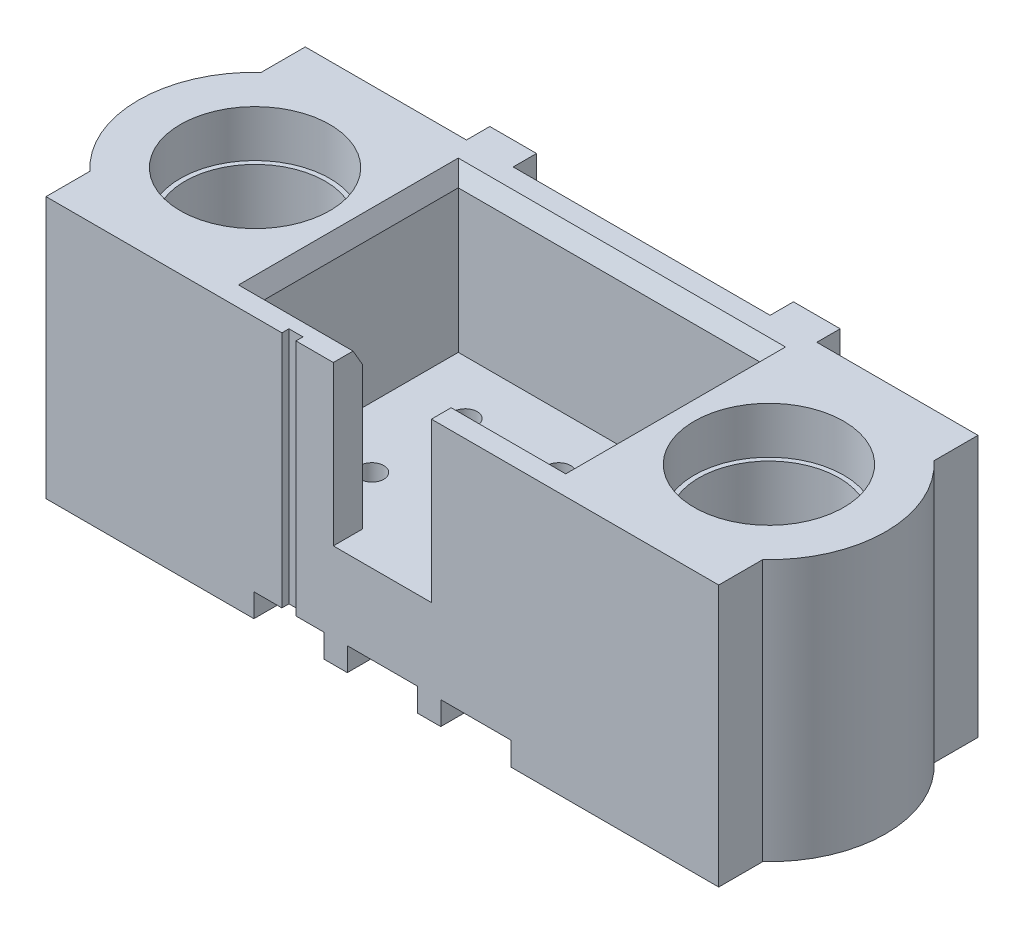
ISO-10303-21;
HEADER;
FILE_DESCRIPTION(('STEP AP214'),'2;1');
FILE_NAME('part.step','',(''),(''),'','','');
FILE_SCHEMA(('AUTOMOTIVE_DESIGN { 1 0 10303 214 1 1 1 1 }'));
ENDSEC;
DATA;
#1=APPLICATION_CONTEXT('core data for automotive mechanical design processes');
#2=APPLICATION_PROTOCOL_DEFINITION('international standard','automotive_design',2000,#1);
#3=PRODUCT_CONTEXT('',#1,'mechanical');
#4=PRODUCT('Part','Part','',(#3));
#5=PRODUCT_RELATED_PRODUCT_CATEGORY('part','',(#4));
#6=PRODUCT_DEFINITION_FORMATION('','',#4);
#7=PRODUCT_DEFINITION_CONTEXT('part definition',#1,'design');
#8=PRODUCT_DEFINITION('design','',#6,#7);
#9=PRODUCT_DEFINITION_SHAPE('','',#8);
#10=(LENGTH_UNIT() NAMED_UNIT(*) SI_UNIT(.MILLI.,.METRE.));
#11=(NAMED_UNIT(*) PLANE_ANGLE_UNIT() SI_UNIT($,.RADIAN.));
#12=(NAMED_UNIT(*) SI_UNIT($,.STERADIAN.) SOLID_ANGLE_UNIT());
#13=UNCERTAINTY_MEASURE_WITH_UNIT(LENGTH_MEASURE(1.E-05),#10,'distance_accuracy_value','');
#14=(GEOMETRIC_REPRESENTATION_CONTEXT(3) GLOBAL_UNCERTAINTY_ASSIGNED_CONTEXT((#13)) GLOBAL_UNIT_ASSIGNED_CONTEXT((#10,
#11,#12)) REPRESENTATION_CONTEXT('',''));
#15=CARTESIAN_POINT('',(0.,0.,0.));
#16=DIRECTION('',(0.,0.,1.));
#17=DIRECTION('',(1.,0.,0.));
#18=AXIS2_PLACEMENT_3D('',#15,#16,#17);
#19=CARTESIAN_POINT('',(-0.75,-2.2,2.775));
#20=DIRECTION('',(0.,-1.,0.));
#21=DIRECTION('',(0.,0.,-1.));
#22=AXIS2_PLACEMENT_3D('',#19,#20,#21);
#23=PLANE('',#22);
#24=DIRECTION('',(0.,0.,-1.));
#25=VECTOR('',#24,1.);
#26=CARTESIAN_POINT('',(-0.75,-2.2,2.775));
#27=LINE('',#26,#25);
#28=CARTESIAN_POINT('',(-0.75,-2.2,2.775));
#29=VERTEX_POINT('',#28);
#30=CARTESIAN_POINT('',(-0.75,-2.2,-2.775));
#31=VERTEX_POINT('',#30);
#32=EDGE_CURVE('E554',#29,#31,#27,.T.);
#33=ORIENTED_EDGE('',*,*,#32,.F.);
#34=DIRECTION('',(1.,0.,0.));
#35=VECTOR('',#34,1.);
#36=CARTESIAN_POINT('',(-0.75,-2.2,2.775));
#37=LINE('',#36,#35);
#38=CARTESIAN_POINT('',(-1.25,-2.2,2.775));
#39=VERTEX_POINT('',#38);
#40=EDGE_CURVE('E607',#29,#39,#37,.F.);
#41=ORIENTED_EDGE('',*,*,#40,.T.);
#42=DIRECTION('',(0.,0.,1.));
#43=VECTOR('',#42,1.);
#44=CARTESIAN_POINT('',(-1.25,-2.2,2.775));
#45=LINE('',#44,#43);
#46=CARTESIAN_POINT('',(-1.25,-2.2,-2.775));
#47=VERTEX_POINT('',#46);
#48=EDGE_CURVE('E577',#47,#39,#45,.T.);
#49=ORIENTED_EDGE('',*,*,#48,.F.);
#50=DIRECTION('',(1.,0.,0.));
#51=VECTOR('',#50,1.);
#52=CARTESIAN_POINT('',(-0.75,-2.2,-2.775));
#53=LINE('',#52,#51);
#54=EDGE_CURVE('E610',#47,#31,#53,.T.);
#55=ORIENTED_EDGE('',*,*,#54,.T.);
#56=EDGE_LOOP('',(#33,#41,#49,#55));
#57=FACE_BOUND('',#56,.T.);
#58=ADVANCED_FACE('F19',(#57),#23,.T.);
#59=CARTESIAN_POINT('',(1.25,-2.2,2.775));
#60=DIRECTION('',(0.,-1.,0.));
#61=DIRECTION('',(0.,0.,-1.));
#62=AXIS2_PLACEMENT_3D('',#59,#60,#61);
#63=PLANE('',#62);
#64=DIRECTION('',(0.,0.,-1.));
#65=VECTOR('',#64,1.);
#66=CARTESIAN_POINT('',(1.25,-2.2,2.775));
#67=LINE('',#66,#65);
#68=CARTESIAN_POINT('',(1.25,-2.2,2.775));
#69=VERTEX_POINT('',#68);
#70=CARTESIAN_POINT('',(1.25,-2.2,-2.775));
#71=VERTEX_POINT('',#70);
#72=EDGE_CURVE('E542',#69,#71,#67,.T.);
#73=ORIENTED_EDGE('',*,*,#72,.F.);
#74=DIRECTION('',(1.,0.,0.));
#75=VECTOR('',#74,1.);
#76=CARTESIAN_POINT('',(1.25,-2.2,2.775));
#77=LINE('',#76,#75);
#78=CARTESIAN_POINT('',(0.75,-2.2,2.775));
#79=VERTEX_POINT('',#78);
#80=EDGE_CURVE('E585',#69,#79,#77,.F.);
#81=ORIENTED_EDGE('',*,*,#80,.T.);
#82=DIRECTION('',(0.,0.,1.));
#83=VECTOR('',#82,1.);
#84=CARTESIAN_POINT('',(0.75,-2.2,2.775));
#85=LINE('',#84,#83);
#86=CARTESIAN_POINT('',(0.75,-2.2,-2.775));
#87=VERTEX_POINT('',#86);
#88=EDGE_CURVE('E565',#87,#79,#85,.T.);
#89=ORIENTED_EDGE('',*,*,#88,.F.);
#90=DIRECTION('',(1.,0.,0.));
#91=VECTOR('',#90,1.);
#92=CARTESIAN_POINT('',(1.25,-2.2,-2.775));
#93=LINE('',#92,#91);
#94=EDGE_CURVE('E604',#87,#71,#93,.T.);
#95=ORIENTED_EDGE('',*,*,#94,.T.);
#96=EDGE_LOOP('',(#73,#81,#89,#95));
#97=FACE_BOUND('',#96,.T.);
#98=ADVANCED_FACE('F1305',(#97),#63,.T.);
#99=CARTESIAN_POINT('',(0.,-1.4,0.));
#100=DIRECTION('',(0.,1.,0.));
#101=DIRECTION('',(0.,0.,1.));
#102=AXIS2_PLACEMENT_3D('',#99,#100,#101);
#103=PLANE('',#102);
#104=CARTESIAN_POINT('',(-5.5,-1.4,0.));
#105=DIRECTION('',(0.,-1.,0.));
#106=DIRECTION('',(0.,0.,-1.));
#107=AXIS2_PLACEMENT_3D('',#104,#105,#106);
#108=CIRCLE('',#107,1.5);
#109=CARTESIAN_POINT('',(-5.5,-1.4,-1.5));
#110=VERTEX_POINT('',#109);
#111=EDGE_CURVE('E779',#110,#110,#108,.F.);
#112=ORIENTED_EDGE('',*,*,#111,.T.);
#113=EDGE_LOOP('',(#112));
#114=FACE_BOUND('',#113,.T.);
#115=CARTESIAN_POINT('',(-4.05,-1.4,-1.45));
#116=DIRECTION('',(0.,-1.,0.));
#117=DIRECTION('',(0.,0.,-1.));
#118=AXIS2_PLACEMENT_3D('',#115,#116,#117);
#119=CIRCLE('',#118,0.1);
#120=CARTESIAN_POINT('',(-4.05,-1.4,-1.55));
#121=VERTEX_POINT('',#120);
#122=CARTESIAN_POINT('',(-3.95,-1.4,-1.45));
#123=VERTEX_POINT('',#122);
#124=EDGE_CURVE('E594',#121,#123,#119,.T.);
#125=ORIENTED_EDGE('',*,*,#124,.T.);
#126=DIRECTION('',(0.,0.,1.));
#127=VECTOR('',#126,1.);
#128=CARTESIAN_POINT('',(-3.95,-1.4,1.55));
#129=LINE('',#128,#127);
#130=CARTESIAN_POINT('',(-3.95,-1.4,1.45));
#131=VERTEX_POINT('',#130);
#132=EDGE_CURVE('E590',#131,#123,#129,.F.);
#133=ORIENTED_EDGE('',*,*,#132,.F.);
#134=CARTESIAN_POINT('',(-4.05,-1.4,1.45));
#135=DIRECTION('',(0.,-1.,0.));
#136=DIRECTION('',(0.,0.,-1.));
#137=AXIS2_PLACEMENT_3D('',#134,#135,#136);
#138=CIRCLE('',#137,0.1);
#139=CARTESIAN_POINT('',(-4.05,-1.4,1.55));
#140=VERTEX_POINT('',#139);
#141=EDGE_CURVE('E599',#131,#140,#138,.T.);
#142=ORIENTED_EDGE('',*,*,#141,.T.);
#143=DIRECTION('',(-1.,0.,0.));
#144=VECTOR('',#143,1.);
#145=CARTESIAN_POINT('',(-7.05,-1.4,1.55));
#146=LINE('',#145,#144);
#147=CARTESIAN_POINT('',(-6.95,-1.4,1.55));
#148=VERTEX_POINT('',#147);
#149=EDGE_CURVE('E596',#148,#140,#146,.F.);
#150=ORIENTED_EDGE('',*,*,#149,.F.);
#151=CARTESIAN_POINT('',(-6.95,-1.4,1.45));
#152=DIRECTION('',(0.,-1.,0.));
#153=DIRECTION('',(0.,0.,-1.));
#154=AXIS2_PLACEMENT_3D('',#151,#152,#153);
#155=CIRCLE('',#154,0.1);
#156=CARTESIAN_POINT('',(-7.05,-1.4,1.45));
#157=VERTEX_POINT('',#156);
#158=EDGE_CURVE('E489',#148,#157,#155,.T.);
#159=ORIENTED_EDGE('',*,*,#158,.T.);
#160=DIRECTION('',(0.,0.,-1.));
#161=VECTOR('',#160,1.);
#162=CARTESIAN_POINT('',(-7.05,-1.4,-1.55));
#163=LINE('',#162,#161);
#164=CARTESIAN_POINT('',(-7.05,-1.4,-1.45));
#165=VERTEX_POINT('',#164);
#166=EDGE_CURVE('E483',#165,#157,#163,.F.);
#167=ORIENTED_EDGE('',*,*,#166,.F.);
#168=CARTESIAN_POINT('',(-6.95,-1.4,-1.45));
#169=DIRECTION('',(0.,-1.,0.));
#170=DIRECTION('',(0.,0.,-1.));
#171=AXIS2_PLACEMENT_3D('',#168,#169,#170);
#172=CIRCLE('',#171,0.1);
#173=CARTESIAN_POINT('',(-6.95,-1.4,-1.55));
#174=VERTEX_POINT('',#173);
#175=EDGE_CURVE('E22',#165,#174,#172,.T.);
#176=ORIENTED_EDGE('',*,*,#175,.T.);
#177=DIRECTION('',(1.,0.,0.));
#178=VECTOR('',#177,1.);
#179=CARTESIAN_POINT('',(-3.95,-1.4,-1.55));
#180=LINE('',#179,#178);
#181=EDGE_CURVE('E586',#121,#174,#180,.F.);
#182=ORIENTED_EDGE('',*,*,#181,.F.);
#183=EDGE_LOOP('',(#125,#133,#142,#150,#159,#167,#176,#182));
#184=FACE_BOUND('',#183,.T.);
#185=ADVANCED_FACE('F485',(#114,#184),#103,.F.);
#186=CARTESIAN_POINT('',(-1.25,-2.2,2.775));
#187=DIRECTION('',(-1.,0.,0.));
#188=DIRECTION('',(0.,0.,1.));
#189=AXIS2_PLACEMENT_3D('',#186,#187,#188);
#190=PLANE('',#189);
#191=DIRECTION('',(0.,1.,0.));
#192=VECTOR('',#191,1.);
#193=CARTESIAN_POINT('',(-1.25,-2.2,2.775));
#194=LINE('',#193,#192);
#195=CARTESIAN_POINT('',(-1.25,-1.7,2.775));
#196=VERTEX_POINT('',#195);
#197=EDGE_CURVE('E573',#39,#196,#194,.T.);
#198=ORIENTED_EDGE('',*,*,#197,.T.);
#199=DIRECTION('',(0.,0.,1.));
#200=VECTOR('',#199,1.);
#201=CARTESIAN_POINT('',(-1.25,-1.7,3.38));
#202=LINE('',#201,#200);
#203=CARTESIAN_POINT('',(-1.25,-1.7,-2.775));
#204=VERTEX_POINT('',#203);
#205=EDGE_CURVE('E897',#196,#204,#202,.F.);
#206=ORIENTED_EDGE('',*,*,#205,.T.);
#207=DIRECTION('',(0.,1.,0.));
#208=VECTOR('',#207,1.);
#209=CARTESIAN_POINT('',(-1.25,-2.2,-2.775));
#210=LINE('',#209,#208);
#211=EDGE_CURVE('E581',#204,#47,#210,.F.);
#212=ORIENTED_EDGE('',*,*,#211,.T.);
#213=ORIENTED_EDGE('',*,*,#48,.T.);
#214=EDGE_LOOP('',(#198,#206,#212,#213));
#215=FACE_BOUND('',#214,.T.);
#216=ADVANCED_FACE('F1286',(#215),#190,.T.);
#217=CARTESIAN_POINT('',(0.75,-2.2,2.775));
#218=DIRECTION('',(-1.,0.,0.));
#219=DIRECTION('',(0.,0.,1.));
#220=AXIS2_PLACEMENT_3D('',#217,#218,#219);
#221=PLANE('',#220);
#222=DIRECTION('',(0.,1.,0.));
#223=VECTOR('',#222,1.);
#224=CARTESIAN_POINT('',(0.75,-2.2,2.775));
#225=LINE('',#224,#223);
#226=CARTESIAN_POINT('',(0.75,-1.7,2.775));
#227=VERTEX_POINT('',#226);
#228=EDGE_CURVE('E562',#79,#227,#225,.T.);
#229=ORIENTED_EDGE('',*,*,#228,.T.);
#230=DIRECTION('',(0.,0.,1.));
#231=VECTOR('',#230,1.);
#232=CARTESIAN_POINT('',(0.75,-1.7,3.38));
#233=LINE('',#232,#231);
#234=CARTESIAN_POINT('',(0.75,-1.7,-2.775));
#235=VERTEX_POINT('',#234);
#236=EDGE_CURVE('E881',#227,#235,#233,.F.);
#237=ORIENTED_EDGE('',*,*,#236,.T.);
#238=DIRECTION('',(0.,1.,0.));
#239=VECTOR('',#238,1.);
#240=CARTESIAN_POINT('',(0.75,-2.2,-2.775));
#241=LINE('',#240,#239);
#242=EDGE_CURVE('E569',#235,#87,#241,.F.);
#243=ORIENTED_EDGE('',*,*,#242,.T.);
#244=ORIENTED_EDGE('',*,*,#88,.T.);
#245=EDGE_LOOP('',(#229,#237,#243,#244));
#246=FACE_BOUND('',#245,.T.);
#247=ADVANCED_FACE('F1303',(#246),#221,.T.);
#248=CARTESIAN_POINT('',(-0.75,-1.7,2.775));
#249=DIRECTION('',(1.,0.,0.));
#250=DIRECTION('',(0.,0.,-1.));
#251=AXIS2_PLACEMENT_3D('',#248,#249,#250);
#252=PLANE('',#251);
#253=DIRECTION('',(0.,1.,0.));
#254=VECTOR('',#253,1.);
#255=CARTESIAN_POINT('',(-0.75,-1.7,-2.775));
#256=LINE('',#255,#254);
#257=CARTESIAN_POINT('',(-0.75,-1.7,-2.775));
#258=VERTEX_POINT('',#257);
#259=EDGE_CURVE('E550',#31,#258,#256,.T.);
#260=ORIENTED_EDGE('',*,*,#259,.T.);
#261=DIRECTION('',(0.,0.,1.));
#262=VECTOR('',#261,1.);
#263=CARTESIAN_POINT('',(-0.75,-1.7,3.38));
#264=LINE('',#263,#262);
#265=CARTESIAN_POINT('',(-0.75,-1.7,2.775));
#266=VERTEX_POINT('',#265);
#267=EDGE_CURVE('E874',#258,#266,#264,.T.);
#268=ORIENTED_EDGE('',*,*,#267,.T.);
#269=DIRECTION('',(0.,1.,0.));
#270=VECTOR('',#269,1.);
#271=CARTESIAN_POINT('',(-0.75,-1.7,2.775));
#272=LINE('',#271,#270);
#273=EDGE_CURVE('E558',#266,#29,#272,.F.);
#274=ORIENTED_EDGE('',*,*,#273,.T.);
#275=ORIENTED_EDGE('',*,*,#32,.T.);
#276=EDGE_LOOP('',(#260,#268,#274,#275));
#277=FACE_BOUND('',#276,.T.);
#278=ADVANCED_FACE('F1292',(#277),#252,.T.);
#279=CARTESIAN_POINT('',(1.25,-1.7,2.775));
#280=DIRECTION('',(1.,0.,0.));
#281=DIRECTION('',(0.,0.,-1.));
#282=AXIS2_PLACEMENT_3D('',#279,#280,#281);
#283=PLANE('',#282);
#284=DIRECTION('',(0.,1.,0.));
#285=VECTOR('',#284,1.);
#286=CARTESIAN_POINT('',(1.25,-1.7,-2.775));
#287=LINE('',#286,#285);
#288=CARTESIAN_POINT('',(1.25,-1.7,-2.775));
#289=VERTEX_POINT('',#288);
#290=EDGE_CURVE('E503',#71,#289,#287,.T.);
#291=ORIENTED_EDGE('',*,*,#290,.T.);
#292=DIRECTION('',(0.,0.,1.));
#293=VECTOR('',#292,1.);
#294=CARTESIAN_POINT('',(1.25,-1.7,3.38));
#295=LINE('',#294,#293);
#296=CARTESIAN_POINT('',(1.25,-1.7,2.775));
#297=VERTEX_POINT('',#296);
#298=EDGE_CURVE('E866',#289,#297,#295,.T.);
#299=ORIENTED_EDGE('',*,*,#298,.T.);
#300=DIRECTION('',(0.,1.,0.));
#301=VECTOR('',#300,1.);
#302=CARTESIAN_POINT('',(1.25,-1.7,2.775));
#303=LINE('',#302,#301);
#304=EDGE_CURVE('E546',#297,#69,#303,.F.);
#305=ORIENTED_EDGE('',*,*,#304,.T.);
#306=ORIENTED_EDGE('',*,*,#72,.T.);
#307=EDGE_LOOP('',(#291,#299,#305,#306));
#308=FACE_BOUND('',#307,.T.);
#309=ADVANCED_FACE('F1308',(#308),#283,.T.);
#310=CARTESIAN_POINT('',(-6.95,-1.375093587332,-1.45));
#311=DIRECTION('',(0.,-1.,0.));
#312=DIRECTION('',(0.,0.,-1.));
#313=AXIS2_PLACEMENT_3D('',#310,#311,#312);
#314=CYLINDRICAL_SURFACE('',#313,0.1);
#315=DIRECTION('',(0.,1.,0.));
#316=VECTOR('',#315,1.);
#317=CARTESIAN_POINT('',(-6.95,-2.2,-1.55));
#318=LINE('',#317,#316);
#319=CARTESIAN_POINT('',(-6.95,-2.2,-1.55));
#320=VERTEX_POINT('',#319);
#321=EDGE_CURVE('E500',#174,#320,#318,.F.);
#322=ORIENTED_EDGE('',*,*,#321,.F.);
#323=ORIENTED_EDGE('',*,*,#175,.F.);
#324=DIRECTION('',(0.,1.,0.));
#325=VECTOR('',#324,1.);
#326=CARTESIAN_POINT('',(-7.05,-2.2,-1.45));
#327=LINE('',#326,#325);
#328=CARTESIAN_POINT('',(-7.05,-2.2,-1.45));
#329=VERTEX_POINT('',#328);
#330=EDGE_CURVE('E494',#329,#165,#327,.T.);
#331=ORIENTED_EDGE('',*,*,#330,.F.);
#332=CARTESIAN_POINT('',(-6.95,-2.2,-1.45));
#333=DIRECTION('',(0.,-1.,0.));
#334=DIRECTION('',(0.,0.,-1.));
#335=AXIS2_PLACEMENT_3D('',#332,#333,#334);
#336=CIRCLE('',#335,0.1);
#337=EDGE_CURVE('E769',#320,#329,#336,.F.);
#338=ORIENTED_EDGE('',*,*,#337,.F.);
#339=EDGE_LOOP('',(#322,#323,#331,#338));
#340=FACE_BOUND('',#339,.T.);
#341=ADVANCED_FACE('F497',(#340),#314,.F.);
#342=CARTESIAN_POINT('',(-7.05,-2.2,-1.55));
#343=DIRECTION('',(1.,0.,0.));
#344=DIRECTION('',(0.,0.,-1.));
#345=AXIS2_PLACEMENT_3D('',#342,#343,#344);
#346=PLANE('',#345);
#347=DIRECTION('',(0.,0.,-1.));
#348=VECTOR('',#347,1.);
#349=CARTESIAN_POINT('',(-7.05,-2.2,0.));
#350=LINE('',#349,#348);
#351=CARTESIAN_POINT('',(-7.05,-2.2,1.45));
#352=VERTEX_POINT('',#351);
#353=EDGE_CURVE('E506',#329,#352,#350,.F.);
#354=ORIENTED_EDGE('',*,*,#353,.F.);
#355=ORIENTED_EDGE('',*,*,#330,.T.);
#356=ORIENTED_EDGE('',*,*,#166,.T.);
#357=DIRECTION('',(0.,-1.,0.));
#358=VECTOR('',#357,1.);
#359=CARTESIAN_POINT('',(-7.05,-1.375093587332,1.45));
#360=LINE('',#359,#358);
#361=EDGE_CURVE('E514',#157,#352,#360,.T.);
#362=ORIENTED_EDGE('',*,*,#361,.T.);
#363=EDGE_LOOP('',(#354,#355,#356,#362));
#364=FACE_BOUND('',#363,.T.);
#365=ADVANCED_FACE('F504',(#364),#346,.T.);
#366=CARTESIAN_POINT('',(-6.95,-1.375093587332,1.45));
#367=DIRECTION('',(0.,-1.,0.));
#368=DIRECTION('',(0.,0.,-1.));
#369=AXIS2_PLACEMENT_3D('',#366,#367,#368);
#370=CYLINDRICAL_SURFACE('',#369,0.1);
#371=ORIENTED_EDGE('',*,*,#361,.F.);
#372=ORIENTED_EDGE('',*,*,#158,.F.);
#373=DIRECTION('',(0.,1.,0.));
#374=VECTOR('',#373,1.);
#375=CARTESIAN_POINT('',(-6.95,-2.2,1.55));
#376=LINE('',#375,#374);
#377=CARTESIAN_POINT('',(-6.95,-2.2,1.55));
#378=VERTEX_POINT('',#377);
#379=EDGE_CURVE('E600',#378,#148,#376,.T.);
#380=ORIENTED_EDGE('',*,*,#379,.F.);
#381=CARTESIAN_POINT('',(-6.95,-2.2,1.45));
#382=DIRECTION('',(0.,-1.,0.));
#383=DIRECTION('',(0.,0.,-1.));
#384=AXIS2_PLACEMENT_3D('',#381,#382,#383);
#385=CIRCLE('',#384,0.1);
#386=EDGE_CURVE('E765',#352,#378,#385,.F.);
#387=ORIENTED_EDGE('',*,*,#386,.F.);
#388=EDGE_LOOP('',(#371,#372,#380,#387));
#389=FACE_BOUND('',#388,.T.);
#390=ADVANCED_FACE('F806',(#389),#370,.F.);
#391=CARTESIAN_POINT('',(-7.05,-2.2,1.55));
#392=DIRECTION('',(0.,0.,-1.));
#393=DIRECTION('',(-1.,0.,0.));
#394=AXIS2_PLACEMENT_3D('',#391,#392,#393);
#395=PLANE('',#394);
#396=ORIENTED_EDGE('',*,*,#149,.T.);
#397=DIRECTION('',(0.,-1.,0.));
#398=VECTOR('',#397,1.);
#399=CARTESIAN_POINT('',(-4.05,-1.375093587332,1.55));
#400=LINE('',#399,#398);
#401=CARTESIAN_POINT('',(-4.05,-2.2,1.55));
#402=VERTEX_POINT('',#401);
#403=EDGE_CURVE('E789',#140,#402,#400,.T.);
#404=ORIENTED_EDGE('',*,*,#403,.T.);
#405=DIRECTION('',(1.,0.,0.));
#406=VECTOR('',#405,1.);
#407=CARTESIAN_POINT('',(0.,-2.2,1.55));
#408=LINE('',#407,#406);
#409=EDGE_CURVE('E764',#378,#402,#408,.T.);
#410=ORIENTED_EDGE('',*,*,#409,.F.);
#411=ORIENTED_EDGE('',*,*,#379,.T.);
#412=EDGE_LOOP('',(#396,#404,#410,#411));
#413=FACE_BOUND('',#412,.T.);
#414=ADVANCED_FACE('F1991',(#413),#395,.T.);
#415=CARTESIAN_POINT('',(-4.05,-1.375093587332,1.45));
#416=DIRECTION('',(0.,-1.,0.));
#417=DIRECTION('',(0.,0.,-1.));
#418=AXIS2_PLACEMENT_3D('',#415,#416,#417);
#419=CYLINDRICAL_SURFACE('',#418,0.1);
#420=ORIENTED_EDGE('',*,*,#403,.F.);
#421=ORIENTED_EDGE('',*,*,#141,.F.);
#422=DIRECTION('',(0.,1.,0.));
#423=VECTOR('',#422,1.);
#424=CARTESIAN_POINT('',(-3.95,-2.2,1.45));
#425=LINE('',#424,#423);
#426=CARTESIAN_POINT('',(-3.95,-2.2,1.45));
#427=VERTEX_POINT('',#426);
#428=EDGE_CURVE('E595',#427,#131,#425,.T.);
#429=ORIENTED_EDGE('',*,*,#428,.F.);
#430=CARTESIAN_POINT('',(-4.05,-2.2,1.45));
#431=DIRECTION('',(0.,-1.,0.));
#432=DIRECTION('',(0.,0.,-1.));
#433=AXIS2_PLACEMENT_3D('',#430,#431,#432);
#434=CIRCLE('',#433,0.1);
#435=EDGE_CURVE('E760',#402,#427,#434,.F.);
#436=ORIENTED_EDGE('',*,*,#435,.F.);
#437=EDGE_LOOP('',(#420,#421,#429,#436));
#438=FACE_BOUND('',#437,.T.);
#439=ADVANCED_FACE('F1983',(#438),#419,.F.);
#440=CARTESIAN_POINT('',(-3.95,-2.2,1.55));
#441=DIRECTION('',(-1.,0.,0.));
#442=DIRECTION('',(0.,0.,1.));
#443=AXIS2_PLACEMENT_3D('',#440,#441,#442);
#444=PLANE('',#443);
#445=ORIENTED_EDGE('',*,*,#132,.T.);
#446=DIRECTION('',(0.,-1.,0.));
#447=VECTOR('',#446,1.);
#448=CARTESIAN_POINT('',(-3.95,-1.375093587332,-1.45));
#449=LINE('',#448,#447);
#450=CARTESIAN_POINT('',(-3.95,-2.2,-1.45));
#451=VERTEX_POINT('',#450);
#452=EDGE_CURVE('E787',#123,#451,#449,.T.);
#453=ORIENTED_EDGE('',*,*,#452,.T.);
#454=DIRECTION('',(0.,0.,-1.));
#455=VECTOR('',#454,1.);
#456=CARTESIAN_POINT('',(-3.95,-2.2,0.));
#457=LINE('',#456,#455);
#458=EDGE_CURVE('E759',#427,#451,#457,.T.);
#459=ORIENTED_EDGE('',*,*,#458,.F.);
#460=ORIENTED_EDGE('',*,*,#428,.T.);
#461=EDGE_LOOP('',(#445,#453,#459,#460));
#462=FACE_BOUND('',#461,.T.);
#463=ADVANCED_FACE('F951',(#462),#444,.T.);
#464=CARTESIAN_POINT('',(-4.05,-1.375093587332,-1.45));
#465=DIRECTION('',(0.,-1.,0.));
#466=DIRECTION('',(0.,0.,-1.));
#467=AXIS2_PLACEMENT_3D('',#464,#465,#466);
#468=CYLINDRICAL_SURFACE('',#467,0.1);
#469=ORIENTED_EDGE('',*,*,#452,.F.);
#470=ORIENTED_EDGE('',*,*,#124,.F.);
#471=DIRECTION('',(0.,1.,0.));
#472=VECTOR('',#471,1.);
#473=CARTESIAN_POINT('',(-4.05,-2.2,-1.55));
#474=LINE('',#473,#472);
#475=CARTESIAN_POINT('',(-4.05,-2.2,-1.55));
#476=VERTEX_POINT('',#475);
#477=EDGE_CURVE('E589',#476,#121,#474,.T.);
#478=ORIENTED_EDGE('',*,*,#477,.F.);
#479=CARTESIAN_POINT('',(-4.05,-2.2,-1.45));
#480=DIRECTION('',(0.,-1.,0.));
#481=DIRECTION('',(0.,0.,-1.));
#482=AXIS2_PLACEMENT_3D('',#479,#480,#481);
#483=CIRCLE('',#482,0.1);
#484=EDGE_CURVE('E754',#451,#476,#483,.F.);
#485=ORIENTED_EDGE('',*,*,#484,.F.);
#486=EDGE_LOOP('',(#469,#470,#478,#485));
#487=FACE_BOUND('',#486,.T.);
#488=ADVANCED_FACE('F954',(#487),#468,.F.);
#489=CARTESIAN_POINT('',(-3.95,-2.2,-1.55));
#490=DIRECTION('',(0.,0.,1.));
#491=DIRECTION('',(1.,0.,0.));
#492=AXIS2_PLACEMENT_3D('',#489,#490,#491);
#493=PLANE('',#492);
#494=ORIENTED_EDGE('',*,*,#181,.T.);
#495=ORIENTED_EDGE('',*,*,#321,.T.);
#496=DIRECTION('',(1.,0.,0.));
#497=VECTOR('',#496,1.);
#498=CARTESIAN_POINT('',(0.,-2.2,-1.55));
#499=LINE('',#498,#497);
#500=EDGE_CURVE('E758',#476,#320,#499,.F.);
#501=ORIENTED_EDGE('',*,*,#500,.F.);
#502=ORIENTED_EDGE('',*,*,#477,.T.);
#503=EDGE_LOOP('',(#494,#495,#501,#502));
#504=FACE_BOUND('',#503,.T.);
#505=ADVANCED_FACE('F1959',(#504),#493,.T.);
#506=CARTESIAN_POINT('',(-3.75,3.4,-3.275));
#507=DIRECTION('',(0.,0.,-1.));
#508=DIRECTION('',(-1.,0.,0.));
#509=AXIS2_PLACEMENT_3D('',#506,#507,#508);
#510=PLANE('',#509);
#511=DIRECTION('',(0.,1.,0.));
#512=VECTOR('',#511,1.);
#513=CARTESIAN_POINT('',(-3.75,3.4,-3.275));
#514=LINE('',#513,#512);
#515=CARTESIAN_POINT('',(-3.75,3.4,-3.275));
#516=VERTEX_POINT('',#515);
#517=CARTESIAN_POINT('',(-3.75,-2.2,-3.275));
#518=VERTEX_POINT('',#517);
#519=EDGE_CURVE('E963',#516,#518,#514,.F.);
#520=ORIENTED_EDGE('',*,*,#519,.F.);
#521=DIRECTION('',(-1.,0.,0.));
#522=VECTOR('',#521,1.);
#523=CARTESIAN_POINT('',(-3.75,3.4,-3.275));
#524=LINE('',#523,#522);
#525=CARTESIAN_POINT('',(-2.75,3.4,-3.275));
#526=VERTEX_POINT('',#525);
#527=EDGE_CURVE('E784',#516,#526,#524,.F.);
#528=ORIENTED_EDGE('',*,*,#527,.T.);
#529=DIRECTION('',(0.,1.,0.));
#530=VECTOR('',#529,1.);
#531=CARTESIAN_POINT('',(-2.75,3.4,-3.275));
#532=LINE('',#531,#530);
#533=CARTESIAN_POINT('',(-2.75,-2.2,-3.275));
#534=VERTEX_POINT('',#533);
#535=EDGE_CURVE('E970',#534,#526,#532,.T.);
#536=ORIENTED_EDGE('',*,*,#535,.F.);
#537=DIRECTION('',(1.,0.,0.));
#538=VECTOR('',#537,1.);
#539=CARTESIAN_POINT('',(0.,-2.2,-3.275));
#540=LINE('',#539,#538);
#541=EDGE_CURVE('E772',#518,#534,#540,.T.);
#542=ORIENTED_EDGE('',*,*,#541,.F.);
#543=EDGE_LOOP('',(#520,#528,#536,#542));
#544=FACE_BOUND('',#543,.T.);
#545=ADVANCED_FACE('F1950',(#544),#510,.T.);
#546=CARTESIAN_POINT('',(-5.5,3.4,0.));
#547=DIRECTION('',(0.,-1.,0.));
#548=DIRECTION('',(0.,0.,-1.));
#549=AXIS2_PLACEMENT_3D('',#546,#547,#548);
#550=CYLINDRICAL_SURFACE('',#549,1.5);
#551=ORIENTED_EDGE('',*,*,#111,.F.);
#552=EDGE_LOOP('',(#551));
#553=FACE_BOUND('',#552,.T.);
#554=CARTESIAN_POINT('',(-5.5,2.4,0.));
#555=DIRECTION('',(0.,-1.,0.));
#556=DIRECTION('',(0.,0.,-1.));
#557=AXIS2_PLACEMENT_3D('',#554,#555,#556);
#558=CIRCLE('',#557,1.5);
#559=CARTESIAN_POINT('',(-5.5,2.4,-1.5));
#560=VERTEX_POINT('',#559);
#561=EDGE_CURVE('E749',#560,#560,#558,.T.);
#562=ORIENTED_EDGE('',*,*,#561,.F.);
#563=EDGE_LOOP('',(#562));
#564=FACE_BOUND('',#563,.T.);
#565=ADVANCED_FACE('F1941',(#553,#564),#550,.F.);
#566=CARTESIAN_POINT('',(5.5,3.4,0.));
#567=DIRECTION('',(0.,-1.,0.));
#568=DIRECTION('',(0.,0.,-1.));
#569=AXIS2_PLACEMENT_3D('',#566,#567,#568);
#570=CYLINDRICAL_SURFACE('',#569,1.5);
#571=CARTESIAN_POINT('',(5.5,-1.4,0.));
#572=DIRECTION('',(0.,-1.,0.));
#573=DIRECTION('',(0.,0.,-1.));
#574=AXIS2_PLACEMENT_3D('',#571,#572,#573);
#575=CIRCLE('',#574,1.5);
#576=CARTESIAN_POINT('',(5.5,-1.4,-1.5));
#577=VERTEX_POINT('',#576);
#578=EDGE_CURVE('E773',#577,#577,#575,.F.);
#579=ORIENTED_EDGE('',*,*,#578,.F.);
#580=EDGE_LOOP('',(#579));
#581=FACE_BOUND('',#580,.T.);
#582=CARTESIAN_POINT('',(5.5,2.4,0.));
#583=DIRECTION('',(0.,-1.,0.));
#584=DIRECTION('',(0.,0.,-1.));
#585=AXIS2_PLACEMENT_3D('',#582,#583,#584);
#586=CIRCLE('',#585,1.5);
#587=CARTESIAN_POINT('',(5.5,2.4,-1.5));
#588=VERTEX_POINT('',#587);
#589=EDGE_CURVE('E745',#588,#588,#586,.F.);
#590=ORIENTED_EDGE('',*,*,#589,.T.);
#591=EDGE_LOOP('',(#590));
#592=FACE_BOUND('',#591,.T.);
#593=ADVANCED_FACE('F1932',(#581,#592),#570,.F.);
#594=CARTESIAN_POINT('',(2.75,-1.7,3.38));
#595=DIRECTION('',(0.,1.,0.));
#596=DIRECTION('',(0.,0.,1.));
#597=AXIS2_PLACEMENT_3D('',#594,#595,#596);
#598=PLANE('',#597);
#599=CARTESIAN_POINT('',(-2.,-1.70000000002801,1.));
#600=DIRECTION('',(0.,-1.,0.));
#601=DIRECTION('',(0.,0.,-1.));
#602=AXIS2_PLACEMENT_3D('',#599,#600,#601);
#603=CIRCLE('',#602,0.434999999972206);
#604=CARTESIAN_POINT('',(-2.,-1.70000000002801,0.565000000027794));
#605=VERTEX_POINT('',#604);
#606=EDGE_CURVE('E729',#605,#605,#603,.F.);
#607=ORIENTED_EDGE('',*,*,#606,.T.);
#608=EDGE_LOOP('',(#607));
#609=FACE_BOUND('',#608,.T.);
#610=CARTESIAN_POINT('',(-2.,-1.70000000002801,-1.));
#611=DIRECTION('',(0.,-1.,0.));
#612=DIRECTION('',(0.,0.,-1.));
#613=AXIS2_PLACEMENT_3D('',#610,#611,#612);
#614=CIRCLE('',#613,0.434999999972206);
#615=CARTESIAN_POINT('',(-2.,-1.70000000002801,-1.43499999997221));
#616=VERTEX_POINT('',#615);
#617=EDGE_CURVE('E733',#616,#616,#614,.F.);
#618=ORIENTED_EDGE('',*,*,#617,.T.);
#619=EDGE_LOOP('',(#618));
#620=FACE_BOUND('',#619,.T.);
#621=DIRECTION('',(0.,0.,1.));
#622=VECTOR('',#621,1.);
#623=CARTESIAN_POINT('',(-2.15,-1.7,3.38));
#624=LINE('',#623,#622);
#625=CARTESIAN_POINT('',(-2.15,-1.7,2.775));
#626=VERTEX_POINT('',#625);
#627=CARTESIAN_POINT('',(-2.15,-1.7,2.625));
#628=VERTEX_POINT('',#627);
#629=EDGE_CURVE('E888',#626,#628,#624,.F.);
#630=ORIENTED_EDGE('',*,*,#629,.F.);
#631=DIRECTION('',(1.,0.,0.));
#632=VECTOR('',#631,1.);
#633=CARTESIAN_POINT('',(2.75,-1.7,2.775));
#634=LINE('',#633,#632);
#635=CARTESIAN_POINT('',(-2.75,-1.7,2.775));
#636=VERTEX_POINT('',#635);
#637=EDGE_CURVE('E891',#636,#626,#634,.T.);
#638=ORIENTED_EDGE('',*,*,#637,.F.);
#639=DIRECTION('',(0.,0.,-1.));
#640=VECTOR('',#639,1.);
#641=CARTESIAN_POINT('',(-2.75,-1.7,-3.275));
#642=LINE('',#641,#640);
#643=CARTESIAN_POINT('',(-2.75,-1.7,-2.775));
#644=VERTEX_POINT('',#643);
#645=EDGE_CURVE('E975',#644,#636,#642,.F.);
#646=ORIENTED_EDGE('',*,*,#645,.F.);
#647=DIRECTION('',(1.,0.,0.));
#648=VECTOR('',#647,1.);
#649=CARTESIAN_POINT('',(2.75,-1.7,-2.775));
#650=LINE('',#649,#648);
#651=EDGE_CURVE('E894',#204,#644,#650,.F.);
#652=ORIENTED_EDGE('',*,*,#651,.F.);
#653=ORIENTED_EDGE('',*,*,#205,.F.);
#654=DIRECTION('',(1.,0.,0.));
#655=VECTOR('',#654,1.);
#656=CARTESIAN_POINT('',(2.75,-1.7,2.775));
#657=LINE('',#656,#655);
#658=CARTESIAN_POINT('',(-1.85,-1.7,2.775));
#659=VERTEX_POINT('',#658);
#660=EDGE_CURVE('E901',#659,#196,#657,.T.);
#661=ORIENTED_EDGE('',*,*,#660,.F.);
#662=DIRECTION('',(0.,0.,1.));
#663=VECTOR('',#662,1.);
#664=CARTESIAN_POINT('',(-1.85,-1.7,3.38));
#665=LINE('',#664,#663);
#666=CARTESIAN_POINT('',(-1.85,-1.7,2.625));
#667=VERTEX_POINT('',#666);
#668=EDGE_CURVE('E783',#667,#659,#665,.T.);
#669=ORIENTED_EDGE('',*,*,#668,.F.);
#670=DIRECTION('',(1.,0.,0.));
#671=VECTOR('',#670,1.);
#672=CARTESIAN_POINT('',(2.75,-1.7,2.625));
#673=LINE('',#672,#671);
#674=EDGE_CURVE('E885',#628,#667,#673,.T.);
#675=ORIENTED_EDGE('',*,*,#674,.F.);
#676=EDGE_LOOP('',(#630,#638,#646,#652,#653,#661,#669,#675));
#677=FACE_BOUND('',#676,.T.);
#678=ADVANCED_FACE('F1281',(#609,#620,#677),#598,.F.);
#679=CARTESIAN_POINT('',(2.75,-1.7,3.38));
#680=DIRECTION('',(0.,1.,0.));
#681=DIRECTION('',(0.,0.,1.));
#682=AXIS2_PLACEMENT_3D('',#679,#680,#681);
#683=PLANE('',#682);
#684=CARTESIAN_POINT('',(0.,-1.70000000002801,1.));
#685=DIRECTION('',(0.,-1.,0.));
#686=DIRECTION('',(0.,0.,-1.));
#687=AXIS2_PLACEMENT_3D('',#684,#685,#686);
#688=CIRCLE('',#687,0.435000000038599);
#689=CARTESIAN_POINT('',(0.,-1.70000000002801,0.564999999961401));
#690=VERTEX_POINT('',#689);
#691=EDGE_CURVE('E725',#690,#690,#688,.F.);
#692=ORIENTED_EDGE('',*,*,#691,.T.);
#693=EDGE_LOOP('',(#692));
#694=FACE_BOUND('',#693,.T.);
#695=CARTESIAN_POINT('',(0.,-1.70000000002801,-1.));
#696=DIRECTION('',(0.,-1.,0.));
#697=DIRECTION('',(0.,0.,-1.));
#698=AXIS2_PLACEMENT_3D('',#695,#696,#697);
#699=CIRCLE('',#698,0.435000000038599);
#700=CARTESIAN_POINT('',(0.,-1.70000000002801,-1.4350000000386));
#701=VERTEX_POINT('',#700);
#702=EDGE_CURVE('E741',#701,#701,#699,.F.);
#703=ORIENTED_EDGE('',*,*,#702,.T.);
#704=EDGE_LOOP('',(#703));
#705=FACE_BOUND('',#704,.T.);
#706=ORIENTED_EDGE('',*,*,#267,.F.);
#707=DIRECTION('',(1.,0.,0.));
#708=VECTOR('',#707,1.);
#709=CARTESIAN_POINT('',(2.75,-1.7,-2.775));
#710=LINE('',#709,#708);
#711=EDGE_CURVE('E878',#235,#258,#710,.F.);
#712=ORIENTED_EDGE('',*,*,#711,.F.);
#713=ORIENTED_EDGE('',*,*,#236,.F.);
#714=DIRECTION('',(1.,0.,0.));
#715=VECTOR('',#714,1.);
#716=CARTESIAN_POINT('',(2.75,-1.7,2.775));
#717=LINE('',#716,#715);
#718=EDGE_CURVE('E870',#266,#227,#717,.T.);
#719=ORIENTED_EDGE('',*,*,#718,.F.);
#720=EDGE_LOOP('',(#706,#712,#713,#719));
#721=FACE_BOUND('',#720,.T.);
#722=ADVANCED_FACE('F1298',(#694,#705,#721),#683,.F.);
#723=CARTESIAN_POINT('',(2.75,-1.7,3.38));
#724=DIRECTION('',(0.,1.,0.));
#725=DIRECTION('',(0.,0.,1.));
#726=AXIS2_PLACEMENT_3D('',#723,#724,#725);
#727=PLANE('',#726);
#728=CARTESIAN_POINT('',(2.,-1.70000000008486,1.));
#729=DIRECTION('',(0.,-1.,0.));
#730=DIRECTION('',(0.,0.,-1.));
#731=AXIS2_PLACEMENT_3D('',#728,#729,#730);
#732=CIRCLE('',#731,0.434999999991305);
#733=CARTESIAN_POINT('',(2.,-1.70000000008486,0.565000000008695));
#734=VERTEX_POINT('',#733);
#735=EDGE_CURVE('E720',#734,#734,#732,.F.);
#736=ORIENTED_EDGE('',*,*,#735,.T.);
#737=EDGE_LOOP('',(#736));
#738=FACE_BOUND('',#737,.T.);
#739=CARTESIAN_POINT('',(2.,-1.70000000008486,-1.));
#740=DIRECTION('',(0.,-1.,0.));
#741=DIRECTION('',(0.,0.,-1.));
#742=AXIS2_PLACEMENT_3D('',#739,#740,#741);
#743=CIRCLE('',#742,0.434999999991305);
#744=CARTESIAN_POINT('',(2.,-1.70000000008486,-1.43499999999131));
#745=VERTEX_POINT('',#744);
#746=EDGE_CURVE('E737',#745,#745,#743,.F.);
#747=ORIENTED_EDGE('',*,*,#746,.T.);
#748=EDGE_LOOP('',(#747));
#749=FACE_BOUND('',#748,.T.);
#750=DIRECTION('',(0.,0.,-1.));
#751=VECTOR('',#750,1.);
#752=CARTESIAN_POINT('',(2.75,-1.7,-3.275));
#753=LINE('',#752,#751);
#754=CARTESIAN_POINT('',(2.75,-1.7,-2.775));
#755=VERTEX_POINT('',#754);
#756=CARTESIAN_POINT('',(2.75,-1.7,2.775));
#757=VERTEX_POINT('',#756);
#758=EDGE_CURVE('E1029',#755,#757,#753,.F.);
#759=ORIENTED_EDGE('',*,*,#758,.T.);
#760=DIRECTION('',(1.,0.,0.));
#761=VECTOR('',#760,1.);
#762=CARTESIAN_POINT('',(2.75,-1.7,2.775));
#763=LINE('',#762,#761);
#764=EDGE_CURVE('E863',#297,#757,#763,.T.);
#765=ORIENTED_EDGE('',*,*,#764,.F.);
#766=ORIENTED_EDGE('',*,*,#298,.F.);
#767=DIRECTION('',(1.,0.,0.));
#768=VECTOR('',#767,1.);
#769=CARTESIAN_POINT('',(2.75,-1.7,-2.775));
#770=LINE('',#769,#768);
#771=EDGE_CURVE('E859',#755,#289,#770,.F.);
#772=ORIENTED_EDGE('',*,*,#771,.F.);
#773=EDGE_LOOP('',(#759,#765,#766,#772));
#774=FACE_BOUND('',#773,.T.);
#775=ADVANCED_FACE('F1315',(#738,#749,#774),#727,.F.);
#776=CARTESIAN_POINT('',(3.75,3.4,-3.275));
#777=DIRECTION('',(0.,0.,1.));
#778=DIRECTION('',(1.,0.,0.));
#779=AXIS2_PLACEMENT_3D('',#776,#777,#778);
#780=PLANE('',#779);
#781=DIRECTION('',(1.,0.,0.));
#782=VECTOR('',#781,1.);
#783=CARTESIAN_POINT('',(3.75,-2.2,-3.275));
#784=LINE('',#783,#782);
#785=CARTESIAN_POINT('',(2.75,-2.2,-3.275));
#786=VERTEX_POINT('',#785);
#787=CARTESIAN_POINT('',(3.75,-2.2,-3.275));
#788=VERTEX_POINT('',#787);
#789=EDGE_CURVE('E778',#786,#788,#784,.T.);
#790=ORIENTED_EDGE('',*,*,#789,.F.);
#791=DIRECTION('',(0.,1.,0.));
#792=VECTOR('',#791,1.);
#793=CARTESIAN_POINT('',(2.75,3.4,-3.275));
#794=LINE('',#793,#792);
#795=CARTESIAN_POINT('',(2.75,3.4,-3.275));
#796=VERTEX_POINT('',#795);
#797=EDGE_CURVE('E1036',#786,#796,#794,.T.);
#798=ORIENTED_EDGE('',*,*,#797,.T.);
#799=DIRECTION('',(1.,0.,0.));
#800=VECTOR('',#799,1.);
#801=CARTESIAN_POINT('',(3.75,3.4,-3.275));
#802=LINE('',#801,#800);
#803=CARTESIAN_POINT('',(3.75,3.4,-3.275));
#804=VERTEX_POINT('',#803);
#805=EDGE_CURVE('E856',#804,#796,#802,.F.);
#806=ORIENTED_EDGE('',*,*,#805,.F.);
#807=DIRECTION('',(0.,1.,0.));
#808=VECTOR('',#807,1.);
#809=CARTESIAN_POINT('',(3.75,3.4,-3.275));
#810=LINE('',#809,#808);
#811=EDGE_CURVE('E986',#804,#788,#810,.F.);
#812=ORIENTED_EDGE('',*,*,#811,.T.);
#813=EDGE_LOOP('',(#790,#798,#806,#812));
#814=FACE_BOUND('',#813,.T.);
#815=ADVANCED_FACE('F1899',(#814),#780,.F.);
#816=CARTESIAN_POINT('',(0.,-1.4,0.));
#817=DIRECTION('',(0.,-1.,0.));
#818=DIRECTION('',(0.,0.,-1.));
#819=AXIS2_PLACEMENT_3D('',#816,#817,#818);
#820=PLANE('',#819);
#821=ORIENTED_EDGE('',*,*,#578,.T.);
#822=EDGE_LOOP('',(#821));
#823=FACE_BOUND('',#822,.T.);
#824=DIRECTION('',(-1.,0.,0.));
#825=VECTOR('',#824,1.);
#826=CARTESIAN_POINT('',(3.95,-1.4,-1.55));
#827=LINE('',#826,#825);
#828=CARTESIAN_POINT('',(4.05,-1.4,-1.55));
#829=VERTEX_POINT('',#828);
#830=CARTESIAN_POINT('',(6.95,-1.4,-1.55));
#831=VERTEX_POINT('',#830);
#832=EDGE_CURVE('E844',#829,#831,#827,.F.);
#833=ORIENTED_EDGE('',*,*,#832,.T.);
#834=CARTESIAN_POINT('',(6.95,-1.4,-1.45));
#835=DIRECTION('',(0.,1.,0.));
#836=DIRECTION('',(0.,0.,1.));
#837=AXIS2_PLACEMENT_3D('',#834,#835,#836);
#838=CIRCLE('',#837,0.1);
#839=CARTESIAN_POINT('',(7.05,-1.4,-1.45));
#840=VERTEX_POINT('',#839);
#841=EDGE_CURVE('E703',#831,#840,#838,.F.);
#842=ORIENTED_EDGE('',*,*,#841,.T.);
#843=DIRECTION('',(0.,0.,-1.));
#844=VECTOR('',#843,1.);
#845=CARTESIAN_POINT('',(7.05,-1.4,-1.55));
#846=LINE('',#845,#844);
#847=CARTESIAN_POINT('',(7.05,-1.4,1.45));
#848=VERTEX_POINT('',#847);
#849=EDGE_CURVE('E713',#840,#848,#846,.F.);
#850=ORIENTED_EDGE('',*,*,#849,.T.);
#851=CARTESIAN_POINT('',(6.95,-1.4,1.45));
#852=DIRECTION('',(0.,1.,0.));
#853=DIRECTION('',(0.,0.,1.));
#854=AXIS2_PLACEMENT_3D('',#851,#852,#853);
#855=CIRCLE('',#854,0.1);
#856=CARTESIAN_POINT('',(6.95,-1.4,1.55));
#857=VERTEX_POINT('',#856);
#858=EDGE_CURVE('E709',#848,#857,#855,.F.);
#859=ORIENTED_EDGE('',*,*,#858,.T.);
#860=DIRECTION('',(1.,0.,0.));
#861=VECTOR('',#860,1.);
#862=CARTESIAN_POINT('',(7.05,-1.4,1.55));
#863=LINE('',#862,#861);
#864=CARTESIAN_POINT('',(4.05,-1.4,1.55));
#865=VERTEX_POINT('',#864);
#866=EDGE_CURVE('E850',#857,#865,#863,.F.);
#867=ORIENTED_EDGE('',*,*,#866,.T.);
#868=CARTESIAN_POINT('',(4.05,-1.4,1.45));
#869=DIRECTION('',(0.,1.,0.));
#870=DIRECTION('',(0.,0.,1.));
#871=AXIS2_PLACEMENT_3D('',#868,#869,#870);
#872=CIRCLE('',#871,0.1);
#873=CARTESIAN_POINT('',(3.95,-1.4,1.45));
#874=VERTEX_POINT('',#873);
#875=EDGE_CURVE('E715',#865,#874,#872,.F.);
#876=ORIENTED_EDGE('',*,*,#875,.T.);
#877=DIRECTION('',(0.,0.,1.));
#878=VECTOR('',#877,1.);
#879=CARTESIAN_POINT('',(3.95,-1.4,1.55));
#880=LINE('',#879,#878);
#881=CARTESIAN_POINT('',(3.95,-1.4,-1.45));
#882=VERTEX_POINT('',#881);
#883=EDGE_CURVE('E529',#874,#882,#880,.F.);
#884=ORIENTED_EDGE('',*,*,#883,.T.);
#885=CARTESIAN_POINT('',(4.05,-1.4,-1.45));
#886=DIRECTION('',(0.,1.,0.));
#887=DIRECTION('',(0.,0.,1.));
#888=AXIS2_PLACEMENT_3D('',#885,#886,#887);
#889=CIRCLE('',#888,0.1);
#890=EDGE_CURVE('E697',#882,#829,#889,.F.);
#891=ORIENTED_EDGE('',*,*,#890,.T.);
#892=EDGE_LOOP('',(#833,#842,#850,#859,#867,#876,#884,#891));
#893=FACE_BOUND('',#892,.T.);
#894=ADVANCED_FACE('F1890',(#823,#893),#820,.T.);
#895=CARTESIAN_POINT('',(-7.2,3.4,2.775));
#896=DIRECTION('',(-1.,0.,0.));
#897=DIRECTION('',(0.,0.,1.));
#898=AXIS2_PLACEMENT_3D('',#895,#896,#897);
#899=PLANE('',#898);
#900=DIRECTION('',(0.,1.,0.));
#901=VECTOR('',#900,1.);
#902=CARTESIAN_POINT('',(-7.2,3.4,2.775));
#903=LINE('',#902,#901);
#904=CARTESIAN_POINT('',(-7.2,3.4,2.775));
#905=VERTEX_POINT('',#904);
#906=CARTESIAN_POINT('',(-7.2,-2.2,2.775));
#907=VERTEX_POINT('',#906);
#908=EDGE_CURVE('E523',#905,#907,#903,.F.);
#909=ORIENTED_EDGE('',*,*,#908,.F.);
#910=DIRECTION('',(0.,0.,1.));
#911=VECTOR('',#910,1.);
#912=CARTESIAN_POINT('',(-7.2,3.4,2.775));
#913=LINE('',#912,#911);
#914=CARTESIAN_POINT('',(-7.20000000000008,3.4,1.83303027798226));
#915=VERTEX_POINT('',#914);
#916=EDGE_CURVE('E777',#905,#915,#913,.F.);
#917=ORIENTED_EDGE('',*,*,#916,.T.);
#918=DIRECTION('',(0.,-1.,0.));
#919=VECTOR('',#918,1.);
#920=CARTESIAN_POINT('',(-7.20000000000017,3.4,1.83303027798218));
#921=LINE('',#920,#919);
#922=CARTESIAN_POINT('',(-7.20000000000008,-2.2,1.83303027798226));
#923=VERTEX_POINT('',#922);
#924=EDGE_CURVE('E695',#923,#915,#921,.F.);
#925=ORIENTED_EDGE('',*,*,#924,.F.);
#926=DIRECTION('',(0.,0.,-1.));
#927=VECTOR('',#926,1.);
#928=CARTESIAN_POINT('',(-7.2,-2.2,0.));
#929=LINE('',#928,#927);
#930=EDGE_CURVE('E821',#907,#923,#929,.T.);
#931=ORIENTED_EDGE('',*,*,#930,.F.);
#932=EDGE_LOOP('',(#909,#917,#925,#931));
#933=FACE_BOUND('',#932,.T.);
#934=ADVANCED_FACE('F1882',(#933),#899,.T.);
#935=CARTESIAN_POINT('',(0.,-2.2,0.));
#936=DIRECTION('',(0.,-1.,0.));
#937=DIRECTION('',(0.,0.,-1.));
#938=AXIS2_PLACEMENT_3D('',#935,#936,#937);
#939=PLANE('',#938);
#940=ORIENTED_EDGE('',*,*,#484,.T.);
#941=ORIENTED_EDGE('',*,*,#500,.T.);
#942=ORIENTED_EDGE('',*,*,#337,.T.);
#943=ORIENTED_EDGE('',*,*,#353,.T.);
#944=ORIENTED_EDGE('',*,*,#386,.T.);
#945=ORIENTED_EDGE('',*,*,#409,.T.);
#946=ORIENTED_EDGE('',*,*,#435,.T.);
#947=ORIENTED_EDGE('',*,*,#458,.T.);
#948=EDGE_LOOP('',(#940,#941,#942,#943,#944,#945,#946,#947));
#949=FACE_BOUND('',#948,.T.);
#950=ORIENTED_EDGE('',*,*,#541,.T.);
#951=DIRECTION('',(0.,0.,-1.));
#952=VECTOR('',#951,1.);
#953=CARTESIAN_POINT('',(-2.75,-2.2,-3.275));
#954=LINE('',#953,#952);
#955=CARTESIAN_POINT('',(-2.75,-2.2,2.775));
#956=VERTEX_POINT('',#955);
#957=EDGE_CURVE('E979',#956,#534,#954,.T.);
#958=ORIENTED_EDGE('',*,*,#957,.F.);
#959=DIRECTION('',(1.,0.,0.));
#960=VECTOR('',#959,1.);
#961=CARTESIAN_POINT('',(7.2,-2.2,2.775));
#962=LINE('',#961,#960);
#963=EDGE_CURVE('E518',#907,#956,#962,.T.);
#964=ORIENTED_EDGE('',*,*,#963,.F.);
#965=ORIENTED_EDGE('',*,*,#930,.T.);
#966=CARTESIAN_POINT('',(-5.5,-2.2,0.));
#967=DIRECTION('',(0.,-1.,0.));
#968=DIRECTION('',(0.,0.,-1.));
#969=AXIS2_PLACEMENT_3D('',#966,#967,#968);
#970=CIRCLE('',#969,2.5);
#971=CARTESIAN_POINT('',(-7.20000000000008,-2.2,-1.83303027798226));
#972=VERTEX_POINT('',#971);
#973=EDGE_CURVE('E691',#972,#923,#970,.F.);
#974=ORIENTED_EDGE('',*,*,#973,.F.);
#975=DIRECTION('',(0.,0.,1.));
#976=VECTOR('',#975,1.);
#977=CARTESIAN_POINT('',(-7.2,-2.2,-1.833030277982));
#978=LINE('',#977,#976);
#979=CARTESIAN_POINT('',(-7.2,-2.2,-2.775));
#980=VERTEX_POINT('',#979);
#981=EDGE_CURVE('E833',#980,#972,#978,.T.);
#982=ORIENTED_EDGE('',*,*,#981,.F.);
#983=DIRECTION('',(-1.,0.,0.));
#984=VECTOR('',#983,1.);
#985=CARTESIAN_POINT('',(-7.2,-2.2,-2.775));
#986=LINE('',#985,#984);
#987=CARTESIAN_POINT('',(-3.75,-2.2,-2.775));
#988=VERTEX_POINT('',#987);
#989=EDGE_CURVE('E931',#988,#980,#986,.T.);
#990=ORIENTED_EDGE('',*,*,#989,.F.);
#991=DIRECTION('',(0.,0.,1.));
#992=VECTOR('',#991,1.);
#993=CARTESIAN_POINT('',(-3.75,-2.2,-2.775));
#994=LINE('',#993,#992);
#995=EDGE_CURVE('E966',#518,#988,#994,.T.);
#996=ORIENTED_EDGE('',*,*,#995,.F.);
#997=EDGE_LOOP('',(#950,#958,#964,#965,#974,#982,#990,#996));
#998=FACE_BOUND('',#997,.T.);
#999=ADVANCED_FACE('F809',(#949,#998),#939,.T.);
#1000=CARTESIAN_POINT('',(-7.2,3.4,-1.833030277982));
#1001=DIRECTION('',(-1.,0.,0.));
#1002=DIRECTION('',(0.,0.,1.));
#1003=AXIS2_PLACEMENT_3D('',#1000,#1001,#1002);
#1004=PLANE('',#1003);
#1005=DIRECTION('',(0.,-1.,0.));
#1006=VECTOR('',#1005,1.);
#1007=CARTESIAN_POINT('',(-7.20000000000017,3.4,-1.83303027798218));
#1008=LINE('',#1007,#1006);
#1009=CARTESIAN_POINT('',(-7.20000000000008,3.4,-1.83303027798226));
#1010=VERTEX_POINT('',#1009);
#1011=EDGE_CURVE('E696',#1010,#972,#1008,.T.);
#1012=ORIENTED_EDGE('',*,*,#1011,.F.);
#1013=DIRECTION('',(0.,0.,1.));
#1014=VECTOR('',#1013,1.);
#1015=CARTESIAN_POINT('',(-7.2,3.4,-1.833030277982));
#1016=LINE('',#1015,#1014);
#1017=CARTESIAN_POINT('',(-7.2,3.4,-2.775));
#1018=VERTEX_POINT('',#1017);
#1019=EDGE_CURVE('E830',#1010,#1018,#1016,.F.);
#1020=ORIENTED_EDGE('',*,*,#1019,.T.);
#1021=DIRECTION('',(0.,1.,0.));
#1022=VECTOR('',#1021,1.);
#1023=CARTESIAN_POINT('',(-7.2,3.4,-2.775));
#1024=LINE('',#1023,#1022);
#1025=EDGE_CURVE('E927',#980,#1018,#1024,.T.);
#1026=ORIENTED_EDGE('',*,*,#1025,.F.);
#1027=ORIENTED_EDGE('',*,*,#981,.T.);
#1028=EDGE_LOOP('',(#1012,#1020,#1026,#1027));
#1029=FACE_BOUND('',#1028,.T.);
#1030=ADVANCED_FACE('F1865',(#1029),#1004,.T.);
#1031=CARTESIAN_POINT('',(-3.75,3.4,-2.775));
#1032=DIRECTION('',(-1.,0.,0.));
#1033=DIRECTION('',(0.,0.,1.));
#1034=AXIS2_PLACEMENT_3D('',#1031,#1032,#1033);
#1035=PLANE('',#1034);
#1036=ORIENTED_EDGE('',*,*,#995,.T.);
#1037=DIRECTION('',(0.,1.,0.));
#1038=VECTOR('',#1037,1.);
#1039=CARTESIAN_POINT('',(-3.75,3.4,-2.775));
#1040=LINE('',#1039,#1038);
#1041=CARTESIAN_POINT('',(-3.75,3.4,-2.775));
#1042=VERTEX_POINT('',#1041);
#1043=EDGE_CURVE('E930',#1042,#988,#1040,.F.);
#1044=ORIENTED_EDGE('',*,*,#1043,.F.);
#1045=DIRECTION('',(0.,0.,1.));
#1046=VECTOR('',#1045,1.);
#1047=CARTESIAN_POINT('',(-3.75,3.4,-2.775));
#1048=LINE('',#1047,#1046);
#1049=EDGE_CURVE('E832',#1042,#516,#1048,.F.);
#1050=ORIENTED_EDGE('',*,*,#1049,.T.);
#1051=ORIENTED_EDGE('',*,*,#519,.T.);
#1052=EDGE_LOOP('',(#1036,#1044,#1050,#1051));
#1053=FACE_BOUND('',#1052,.T.);
#1054=ADVANCED_FACE('F1856',(#1053),#1035,.T.);
#1055=CARTESIAN_POINT('',(-2.75,3.4,-3.275));
#1056=DIRECTION('',(1.,0.,0.));
#1057=DIRECTION('',(0.,0.,-1.));
#1058=AXIS2_PLACEMENT_3D('',#1055,#1056,#1057);
#1059=PLANE('',#1058);
#1060=DIRECTION('',(0.,1.,0.));
#1061=VECTOR('',#1060,1.);
#1062=CARTESIAN_POINT('',(-2.75,3.4,2.775));
#1063=LINE('',#1062,#1061);
#1064=EDGE_CURVE('E522',#956,#636,#1063,.T.);
#1065=ORIENTED_EDGE('',*,*,#1064,.F.);
#1066=ORIENTED_EDGE('',*,*,#957,.T.);
#1067=ORIENTED_EDGE('',*,*,#535,.T.);
#1068=DIRECTION('',(0.,0.,-1.));
#1069=VECTOR('',#1068,1.);
#1070=CARTESIAN_POINT('',(-2.75,3.4,-3.275));
#1071=LINE('',#1070,#1069);
#1072=CARTESIAN_POINT('',(-2.75,3.4,-2.775));
#1073=VERTEX_POINT('',#1072);
#1074=EDGE_CURVE('E973',#526,#1073,#1071,.F.);
#1075=ORIENTED_EDGE('',*,*,#1074,.T.);
#1076=DIRECTION('',(0.,1.,0.));
#1077=VECTOR('',#1076,1.);
#1078=CARTESIAN_POINT('',(-2.75,3.4,-2.775));
#1079=LINE('',#1078,#1077);
#1080=EDGE_CURVE('E1088',#644,#1073,#1079,.T.);
#1081=ORIENTED_EDGE('',*,*,#1080,.F.);
#1082=ORIENTED_EDGE('',*,*,#645,.T.);
#1083=EDGE_LOOP('',(#1065,#1066,#1067,#1075,#1081,#1082));
#1084=FACE_BOUND('',#1083,.T.);
#1085=ADVANCED_FACE('F1847',(#1084),#1059,.T.);
#1086=CARTESIAN_POINT('',(3.75,3.4,-2.775));
#1087=DIRECTION('',(-1.,0.,0.));
#1088=DIRECTION('',(0.,0.,1.));
#1089=AXIS2_PLACEMENT_3D('',#1086,#1087,#1088);
#1090=PLANE('',#1089);
#1091=ORIENTED_EDGE('',*,*,#811,.F.);
#1092=DIRECTION('',(0.,0.,1.));
#1093=VECTOR('',#1092,1.);
#1094=CARTESIAN_POINT('',(3.75,3.4,-2.775));
#1095=LINE('',#1094,#1093);
#1096=CARTESIAN_POINT('',(3.75,3.4,-2.775));
#1097=VERTEX_POINT('',#1096);
#1098=EDGE_CURVE('E983',#1097,#804,#1095,.F.);
#1099=ORIENTED_EDGE('',*,*,#1098,.F.);
#1100=DIRECTION('',(0.,1.,0.));
#1101=VECTOR('',#1100,1.);
#1102=CARTESIAN_POINT('',(3.75,3.4,-2.775));
#1103=LINE('',#1102,#1101);
#1104=CARTESIAN_POINT('',(3.75,-2.2,-2.775));
#1105=VERTEX_POINT('',#1104);
#1106=EDGE_CURVE('E910',#1105,#1097,#1103,.T.);
#1107=ORIENTED_EDGE('',*,*,#1106,.F.);
#1108=DIRECTION('',(0.,0.,1.));
#1109=VECTOR('',#1108,1.);
#1110=CARTESIAN_POINT('',(3.75,-2.2,-2.775));
#1111=LINE('',#1110,#1109);
#1112=EDGE_CURVE('E990',#788,#1105,#1111,.T.);
#1113=ORIENTED_EDGE('',*,*,#1112,.F.);
#1114=EDGE_LOOP('',(#1091,#1099,#1107,#1113));
#1115=FACE_BOUND('',#1114,.T.);
#1116=ADVANCED_FACE('F1838',(#1115),#1090,.F.);
#1117=CARTESIAN_POINT('',(7.2,3.4,-2.775));
#1118=DIRECTION('',(1.,0.,0.));
#1119=DIRECTION('',(0.,0.,-1.));
#1120=AXIS2_PLACEMENT_3D('',#1117,#1118,#1119);
#1121=PLANE('',#1120);
#1122=DIRECTION('',(0.,1.,0.));
#1123=VECTOR('',#1122,1.);
#1124=CARTESIAN_POINT('',(7.2,3.4,-2.775));
#1125=LINE('',#1124,#1123);
#1126=CARTESIAN_POINT('',(7.2,3.4,-2.775));
#1127=VERTEX_POINT('',#1126);
#1128=CARTESIAN_POINT('',(7.2,-2.2,-2.775));
#1129=VERTEX_POINT('',#1128);
#1130=EDGE_CURVE('E906',#1127,#1129,#1125,.F.);
#1131=ORIENTED_EDGE('',*,*,#1130,.F.);
#1132=DIRECTION('',(0.,0.,-1.));
#1133=VECTOR('',#1132,1.);
#1134=CARTESIAN_POINT('',(7.2,3.4,-2.775));
#1135=LINE('',#1134,#1133);
#1136=CARTESIAN_POINT('',(7.20000000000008,3.4,-1.83303027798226));
#1137=VERTEX_POINT('',#1136);
#1138=EDGE_CURVE('E753',#1127,#1137,#1135,.F.);
#1139=ORIENTED_EDGE('',*,*,#1138,.T.);
#1140=DIRECTION('',(0.,-1.,0.));
#1141=VECTOR('',#1140,1.);
#1142=CARTESIAN_POINT('',(7.20000000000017,3.4,-1.83303027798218));
#1143=LINE('',#1142,#1141);
#1144=CARTESIAN_POINT('',(7.20000000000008,-2.2,-1.83303027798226));
#1145=VERTEX_POINT('',#1144);
#1146=EDGE_CURVE('E1097',#1145,#1137,#1143,.F.);
#1147=ORIENTED_EDGE('',*,*,#1146,.F.);
#1148=DIRECTION('',(0.,0.,-1.));
#1149=VECTOR('',#1148,1.);
#1150=CARTESIAN_POINT('',(7.2,-2.2,-2.775));
#1151=LINE('',#1150,#1149);
#1152=EDGE_CURVE('E993',#1145,#1129,#1151,.T.);
#1153=ORIENTED_EDGE('',*,*,#1152,.T.);
#1154=EDGE_LOOP('',(#1131,#1139,#1147,#1153));
#1155=FACE_BOUND('',#1154,.T.);
#1156=ADVANCED_FACE('F1829',(#1155),#1121,.T.);
#1157=CARTESIAN_POINT('',(-5.5,2.4,0.));
#1158=DIRECTION('',(0.,1.,0.));
#1159=DIRECTION('',(0.,0.,1.));
#1160=AXIS2_PLACEMENT_3D('',#1157,#1158,#1159);
#1161=PLANE('',#1160);
#1162=ORIENTED_EDGE('',*,*,#561,.T.);
#1163=EDGE_LOOP('',(#1162));
#1164=FACE_BOUND('',#1163,.T.);
#1165=CARTESIAN_POINT('',(-5.5,2.4,0.));
#1166=DIRECTION('',(0.,1.,0.));
#1167=DIRECTION('',(0.,0.,1.));
#1168=AXIS2_PLACEMENT_3D('',#1165,#1166,#1167);
#1169=CIRCLE('',#1168,1.6);
#1170=CARTESIAN_POINT('',(-5.5,2.4,1.6));
#1171=VERTEX_POINT('',#1170);
#1172=EDGE_CURVE('E686',#1171,#1171,#1169,.T.);
#1173=ORIENTED_EDGE('',*,*,#1172,.T.);
#1174=EDGE_LOOP('',(#1173));
#1175=FACE_BOUND('',#1174,.T.);
#1176=ADVANCED_FACE('F1820',(#1164,#1175),#1161,.T.);
#1177=CARTESIAN_POINT('',(5.5,2.4,0.));
#1178=DIRECTION('',(0.,-1.,0.));
#1179=DIRECTION('',(0.,0.,-1.));
#1180=AXIS2_PLACEMENT_3D('',#1177,#1178,#1179);
#1181=PLANE('',#1180);
#1182=ORIENTED_EDGE('',*,*,#589,.F.);
#1183=EDGE_LOOP('',(#1182));
#1184=FACE_BOUND('',#1183,.T.);
#1185=CARTESIAN_POINT('',(5.5,2.4,0.));
#1186=DIRECTION('',(0.,-1.,0.));
#1187=DIRECTION('',(0.,0.,-1.));
#1188=AXIS2_PLACEMENT_3D('',#1185,#1186,#1187);
#1189=CIRCLE('',#1188,1.6);
#1190=CARTESIAN_POINT('',(5.5,2.4,-1.6));
#1191=VERTEX_POINT('',#1190);
#1192=EDGE_CURVE('E681',#1191,#1191,#1189,.F.);
#1193=ORIENTED_EDGE('',*,*,#1192,.T.);
#1194=EDGE_LOOP('',(#1193));
#1195=FACE_BOUND('',#1194,.T.);
#1196=ADVANCED_FACE('F1811',(#1184,#1195),#1181,.F.);
#1197=CARTESIAN_POINT('',(0.,-1.70000000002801,-1.));
#1198=DIRECTION('',(0.,-1.,0.));
#1199=DIRECTION('',(0.,0.,-1.));
#1200=AXIS2_PLACEMENT_3D('',#1197,#1198,#1199);
#1201=CONICAL_SURFACE('',#1200,0.435000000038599,0.78539816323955);
#1202=CARTESIAN_POINT('',(0.,-1.52,-1.));
#1203=DIRECTION('',(0.,-1.,0.));
#1204=DIRECTION('',(0.,0.,-1.));
#1205=AXIS2_PLACEMENT_3D('',#1202,#1203,#1204);
#1206=CIRCLE('',#1205,0.255);
#1207=CARTESIAN_POINT('',(0.,-1.52,-1.255));
#1208=VERTEX_POINT('',#1207);
#1209=EDGE_CURVE('E1002',#1208,#1208,#1206,.F.);
#1210=ORIENTED_EDGE('',*,*,#1209,.T.);
#1211=EDGE_LOOP('',(#1210));
#1212=FACE_BOUND('',#1211,.T.);
#1213=ORIENTED_EDGE('',*,*,#702,.F.);
#1214=EDGE_LOOP('',(#1213));
#1215=FACE_BOUND('',#1214,.T.);
#1216=ADVANCED_FACE('F1802',(#1212,#1215),#1201,.F.);
#1217=CARTESIAN_POINT('',(2.,-1.70000000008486,-1.));
#1218=DIRECTION('',(0.,-1.,0.));
#1219=DIRECTION('',(0.,0.,-1.));
#1220=AXIS2_PLACEMENT_3D('',#1217,#1218,#1219);
#1221=CONICAL_SURFACE('',#1220,0.434999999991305,0.785398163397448);
#1222=CARTESIAN_POINT('',(2.,-1.52,-1.));
#1223=DIRECTION('',(0.,-1.,0.));
#1224=DIRECTION('',(0.,0.,-1.));
#1225=AXIS2_PLACEMENT_3D('',#1222,#1223,#1224);
#1226=CIRCLE('',#1225,0.255);
#1227=CARTESIAN_POINT('',(2.,-1.52,-1.255));
#1228=VERTEX_POINT('',#1227);
#1229=EDGE_CURVE('E1006',#1228,#1228,#1226,.F.);
#1230=ORIENTED_EDGE('',*,*,#1229,.T.);
#1231=EDGE_LOOP('',(#1230));
#1232=FACE_BOUND('',#1231,.T.);
#1233=ORIENTED_EDGE('',*,*,#746,.F.);
#1234=EDGE_LOOP('',(#1233));
#1235=FACE_BOUND('',#1234,.T.);
#1236=ADVANCED_FACE('F1793',(#1232,#1235),#1221,.F.);
#1237=CARTESIAN_POINT('',(-2.,-1.70000000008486,-1.));
#1238=DIRECTION('',(0.,-1.,0.));
#1239=DIRECTION('',(0.,0.,-1.));
#1240=AXIS2_PLACEMENT_3D('',#1237,#1238,#1239);
#1241=CONICAL_SURFACE('',#1240,0.435000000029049,0.785398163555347);
#1242=CARTESIAN_POINT('',(-2.,-1.52,-1.));
#1243=DIRECTION('',(0.,-1.,0.));
#1244=DIRECTION('',(0.,0.,-1.));
#1245=AXIS2_PLACEMENT_3D('',#1242,#1243,#1244);
#1246=CIRCLE('',#1245,0.255);
#1247=CARTESIAN_POINT('',(-2.,-1.52,-1.255));
#1248=VERTEX_POINT('',#1247);
#1249=EDGE_CURVE('E1011',#1248,#1248,#1246,.F.);
#1250=ORIENTED_EDGE('',*,*,#1249,.T.);
#1251=EDGE_LOOP('',(#1250));
#1252=FACE_BOUND('',#1251,.T.);
#1253=ORIENTED_EDGE('',*,*,#617,.F.);
#1254=EDGE_LOOP('',(#1253));
#1255=FACE_BOUND('',#1254,.T.);
#1256=ADVANCED_FACE('F1784',(#1252,#1255),#1241,.F.);
#1257=CARTESIAN_POINT('',(-2.,-1.70000000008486,1.));
#1258=DIRECTION('',(0.,-1.,0.));
#1259=DIRECTION('',(0.,0.,-1.));
#1260=AXIS2_PLACEMENT_3D('',#1257,#1258,#1259);
#1261=CONICAL_SURFACE('',#1260,0.435000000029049,0.785398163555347);
#1262=CARTESIAN_POINT('',(-2.,-1.52,1.));
#1263=DIRECTION('',(0.,-1.,0.));
#1264=DIRECTION('',(0.,0.,-1.));
#1265=AXIS2_PLACEMENT_3D('',#1262,#1263,#1264);
#1266=CIRCLE('',#1265,0.255);
#1267=CARTESIAN_POINT('',(-2.,-1.52,0.745));
#1268=VERTEX_POINT('',#1267);
#1269=EDGE_CURVE('E1015',#1268,#1268,#1266,.F.);
#1270=ORIENTED_EDGE('',*,*,#1269,.T.);
#1271=EDGE_LOOP('',(#1270));
#1272=FACE_BOUND('',#1271,.T.);
#1273=ORIENTED_EDGE('',*,*,#606,.F.);
#1274=EDGE_LOOP('',(#1273));
#1275=FACE_BOUND('',#1274,.T.);
#1276=ADVANCED_FACE('F1775',(#1272,#1275),#1261,.F.);
#1277=CARTESIAN_POINT('',(0.,-1.70000000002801,1.));
#1278=DIRECTION('',(0.,-1.,0.));
#1279=DIRECTION('',(0.,0.,-1.));
#1280=AXIS2_PLACEMENT_3D('',#1277,#1278,#1279);
#1281=CONICAL_SURFACE('',#1280,0.435000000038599,0.78539816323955);
#1282=CARTESIAN_POINT('',(0.,-1.52,1.));
#1283=DIRECTION('',(0.,-1.,0.));
#1284=DIRECTION('',(0.,0.,-1.));
#1285=AXIS2_PLACEMENT_3D('',#1282,#1283,#1284);
#1286=CIRCLE('',#1285,0.255);
#1287=CARTESIAN_POINT('',(0.,-1.52,0.745));
#1288=VERTEX_POINT('',#1287);
#1289=EDGE_CURVE('E1019',#1288,#1288,#1286,.F.);
#1290=ORIENTED_EDGE('',*,*,#1289,.T.);
#1291=EDGE_LOOP('',(#1290));
#1292=FACE_BOUND('',#1291,.T.);
#1293=ORIENTED_EDGE('',*,*,#691,.F.);
#1294=EDGE_LOOP('',(#1293));
#1295=FACE_BOUND('',#1294,.T.);
#1296=ADVANCED_FACE('F1766',(#1292,#1295),#1281,.F.);
#1297=CARTESIAN_POINT('',(2.,-1.70000000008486,1.));
#1298=DIRECTION('',(0.,-1.,0.));
#1299=DIRECTION('',(0.,0.,-1.));
#1300=AXIS2_PLACEMENT_3D('',#1297,#1298,#1299);
#1301=CONICAL_SURFACE('',#1300,0.434999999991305,0.785398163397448);
#1302=CARTESIAN_POINT('',(2.,-1.52,1.));
#1303=DIRECTION('',(0.,-1.,0.));
#1304=DIRECTION('',(0.,0.,-1.));
#1305=AXIS2_PLACEMENT_3D('',#1302,#1303,#1304);
#1306=CIRCLE('',#1305,0.255);
#1307=CARTESIAN_POINT('',(2.,-1.52,0.745));
#1308=VERTEX_POINT('',#1307);
#1309=EDGE_CURVE('E1023',#1308,#1308,#1306,.F.);
#1310=ORIENTED_EDGE('',*,*,#1309,.T.);
#1311=EDGE_LOOP('',(#1310));
#1312=FACE_BOUND('',#1311,.T.);
#1313=ORIENTED_EDGE('',*,*,#735,.F.);
#1314=EDGE_LOOP('',(#1313));
#1315=FACE_BOUND('',#1314,.T.);
#1316=ADVANCED_FACE('F1757',(#1312,#1315),#1301,.F.);
#1317=CARTESIAN_POINT('',(-2.15,3.4,2.625));
#1318=DIRECTION('',(-1.,0.,0.));
#1319=DIRECTION('',(0.,0.,1.));
#1320=AXIS2_PLACEMENT_3D('',#1317,#1318,#1319);
#1321=PLANE('',#1320);
#1322=ORIENTED_EDGE('',*,*,#629,.T.);
#1323=DIRECTION('',(0.,1.,0.));
#1324=VECTOR('',#1323,1.);
#1325=CARTESIAN_POINT('',(-2.15,3.4,2.625));
#1326=LINE('',#1325,#1324);
#1327=CARTESIAN_POINT('',(-2.15,3.4,2.625));
#1328=VERTEX_POINT('',#1327);
#1329=EDGE_CURVE('E923',#628,#1328,#1326,.T.);
#1330=ORIENTED_EDGE('',*,*,#1329,.T.);
#1331=DIRECTION('',(0.,0.,1.));
#1332=VECTOR('',#1331,1.);
#1333=CARTESIAN_POINT('',(-2.15,3.4,2.625));
#1334=LINE('',#1333,#1332);
#1335=CARTESIAN_POINT('',(-2.15,3.4,2.775));
#1336=VERTEX_POINT('',#1335);
#1337=EDGE_CURVE('E724',#1336,#1328,#1334,.F.);
#1338=ORIENTED_EDGE('',*,*,#1337,.F.);
#1339=DIRECTION('',(0.,1.,0.));
#1340=VECTOR('',#1339,1.);
#1341=CARTESIAN_POINT('',(-2.15,3.4,2.775));
#1342=LINE('',#1341,#1340);
#1343=EDGE_CURVE('E1077',#626,#1336,#1342,.T.);
#1344=ORIENTED_EDGE('',*,*,#1343,.F.);
#1345=EDGE_LOOP('',(#1322,#1330,#1338,#1344));
#1346=FACE_BOUND('',#1345,.T.);
#1347=ADVANCED_FACE('F1749',(#1346),#1321,.F.);
#1348=CARTESIAN_POINT('',(2.75,3.4,-3.275));
#1349=DIRECTION('',(1.,0.,0.));
#1350=DIRECTION('',(0.,0.,-1.));
#1351=AXIS2_PLACEMENT_3D('',#1348,#1349,#1350);
#1352=PLANE('',#1351);
#1353=ORIENTED_EDGE('',*,*,#797,.F.);
#1354=DIRECTION('',(0.,0.,-1.));
#1355=VECTOR('',#1354,1.);
#1356=CARTESIAN_POINT('',(2.75,-2.2,0.));
#1357=LINE('',#1356,#1355);
#1358=CARTESIAN_POINT('',(2.75,-2.2,2.775));
#1359=VERTEX_POINT('',#1358);
#1360=EDGE_CURVE('E676',#1359,#786,#1357,.T.);
#1361=ORIENTED_EDGE('',*,*,#1360,.F.);
#1362=DIRECTION('',(0.,1.,0.));
#1363=VECTOR('',#1362,1.);
#1364=CARTESIAN_POINT('',(2.75,3.4,2.775));
#1365=LINE('',#1364,#1363);
#1366=EDGE_CURVE('E1033',#757,#1359,#1365,.F.);
#1367=ORIENTED_EDGE('',*,*,#1366,.F.);
#1368=ORIENTED_EDGE('',*,*,#758,.F.);
#1369=DIRECTION('',(0.,1.,0.));
#1370=VECTOR('',#1369,1.);
#1371=CARTESIAN_POINT('',(2.75,3.4,-2.775));
#1372=LINE('',#1371,#1370);
#1373=CARTESIAN_POINT('',(2.75,3.4,-2.775));
#1374=VERTEX_POINT('',#1373);
#1375=EDGE_CURVE('E911',#1374,#755,#1372,.F.);
#1376=ORIENTED_EDGE('',*,*,#1375,.F.);
#1377=DIRECTION('',(0.,0.,-1.));
#1378=VECTOR('',#1377,1.);
#1379=CARTESIAN_POINT('',(2.75,3.4,-3.275));
#1380=LINE('',#1379,#1378);
#1381=EDGE_CURVE('E719',#796,#1374,#1380,.F.);
#1382=ORIENTED_EDGE('',*,*,#1381,.F.);
#1383=EDGE_LOOP('',(#1353,#1361,#1367,#1368,#1376,#1382));
#1384=FACE_BOUND('',#1383,.T.);
#1385=ADVANCED_FACE('F1319',(#1384),#1352,.F.);
#1386=CARTESIAN_POINT('',(4.05,-2.229149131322,1.45));
#1387=DIRECTION('',(0.,1.,0.));
#1388=DIRECTION('',(0.,0.,1.));
#1389=AXIS2_PLACEMENT_3D('',#1386,#1387,#1388);
#1390=CYLINDRICAL_SURFACE('',#1389,0.1);
#1391=DIRECTION('',(0.,1.,0.));
#1392=VECTOR('',#1391,1.);
#1393=CARTESIAN_POINT('',(4.05,-2.2,1.55));
#1394=LINE('',#1393,#1392);
#1395=CARTESIAN_POINT('',(4.05,-2.2,1.55));
#1396=VERTEX_POINT('',#1395);
#1397=EDGE_CURVE('E718',#865,#1396,#1394,.F.);
#1398=ORIENTED_EDGE('',*,*,#1397,.T.);
#1399=CARTESIAN_POINT('',(4.05,-2.2,1.45));
#1400=DIRECTION('',(0.,1.,0.));
#1401=DIRECTION('',(0.,0.,1.));
#1402=AXIS2_PLACEMENT_3D('',#1399,#1400,#1401);
#1403=CIRCLE('',#1402,0.1);
#1404=CARTESIAN_POINT('',(3.95,-2.2,1.45));
#1405=VERTEX_POINT('',#1404);
#1406=EDGE_CURVE('E672',#1405,#1396,#1403,.T.);
#1407=ORIENTED_EDGE('',*,*,#1406,.F.);
#1408=DIRECTION('',(0.,1.,0.));
#1409=VECTOR('',#1408,1.);
#1410=CARTESIAN_POINT('',(3.95,-2.2,1.45));
#1411=LINE('',#1410,#1409);
#1412=EDGE_CURVE('E843',#1405,#874,#1411,.T.);
#1413=ORIENTED_EDGE('',*,*,#1412,.T.);
#1414=ORIENTED_EDGE('',*,*,#875,.F.);
#1415=EDGE_LOOP('',(#1398,#1407,#1413,#1414));
#1416=FACE_BOUND('',#1415,.T.);
#1417=ADVANCED_FACE('F1732',(#1416),#1390,.F.);
#1418=CARTESIAN_POINT('',(7.05,-2.2,1.55));
#1419=DIRECTION('',(0.,0.,1.));
#1420=DIRECTION('',(1.,0.,0.));
#1421=AXIS2_PLACEMENT_3D('',#1418,#1419,#1420);
#1422=PLANE('',#1421);
#1423=DIRECTION('',(0.,1.,0.));
#1424=VECTOR('',#1423,1.);
#1425=CARTESIAN_POINT('',(6.95,-2.229149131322,1.55));
#1426=LINE('',#1425,#1424);
#1427=CARTESIAN_POINT('',(6.95,-2.2,1.55));
#1428=VERTEX_POINT('',#1427);
#1429=EDGE_CURVE('E714',#857,#1428,#1426,.F.);
#1430=ORIENTED_EDGE('',*,*,#1429,.T.);
#1431=DIRECTION('',(1.,0.,0.));
#1432=VECTOR('',#1431,1.);
#1433=CARTESIAN_POINT('',(0.,-2.2,1.55));
#1434=LINE('',#1433,#1432);
#1435=EDGE_CURVE('E671',#1396,#1428,#1434,.T.);
#1436=ORIENTED_EDGE('',*,*,#1435,.F.);
#1437=ORIENTED_EDGE('',*,*,#1397,.F.);
#1438=ORIENTED_EDGE('',*,*,#866,.F.);
#1439=EDGE_LOOP('',(#1430,#1436,#1437,#1438));
#1440=FACE_BOUND('',#1439,.T.);
#1441=ADVANCED_FACE('F1723',(#1440),#1422,.F.);
#1442=CARTESIAN_POINT('',(6.95,-2.229149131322,1.45));
#1443=DIRECTION('',(0.,1.,0.));
#1444=DIRECTION('',(0.,0.,1.));
#1445=AXIS2_PLACEMENT_3D('',#1442,#1443,#1444);
#1446=CYLINDRICAL_SURFACE('',#1445,0.1);
#1447=DIRECTION('',(0.,1.,0.));
#1448=VECTOR('',#1447,1.);
#1449=CARTESIAN_POINT('',(7.05,-2.2,1.45));
#1450=LINE('',#1449,#1448);
#1451=CARTESIAN_POINT('',(7.05,-2.2,1.45));
#1452=VERTEX_POINT('',#1451);
#1453=EDGE_CURVE('E849',#848,#1452,#1450,.F.);
#1454=ORIENTED_EDGE('',*,*,#1453,.T.);
#1455=CARTESIAN_POINT('',(6.95,-2.2,1.45));
#1456=DIRECTION('',(0.,1.,0.));
#1457=DIRECTION('',(0.,0.,1.));
#1458=AXIS2_PLACEMENT_3D('',#1455,#1456,#1457);
#1459=CIRCLE('',#1458,0.1);
#1460=EDGE_CURVE('E667',#1428,#1452,#1459,.T.);
#1461=ORIENTED_EDGE('',*,*,#1460,.F.);
#1462=ORIENTED_EDGE('',*,*,#1429,.F.);
#1463=ORIENTED_EDGE('',*,*,#858,.F.);
#1464=EDGE_LOOP('',(#1454,#1461,#1462,#1463));
#1465=FACE_BOUND('',#1464,.T.);
#1466=ADVANCED_FACE('F1714',(#1465),#1446,.F.);
#1467=CARTESIAN_POINT('',(7.05,-2.2,-1.55));
#1468=DIRECTION('',(1.,0.,0.));
#1469=DIRECTION('',(0.,0.,-1.));
#1470=AXIS2_PLACEMENT_3D('',#1467,#1468,#1469);
#1471=PLANE('',#1470);
#1472=ORIENTED_EDGE('',*,*,#1453,.F.);
#1473=ORIENTED_EDGE('',*,*,#849,.F.);
#1474=DIRECTION('',(0.,1.,0.));
#1475=VECTOR('',#1474,1.);
#1476=CARTESIAN_POINT('',(7.05,-2.229149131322,-1.45));
#1477=LINE('',#1476,#1475);
#1478=CARTESIAN_POINT('',(7.05,-2.2,-1.45));
#1479=VERTEX_POINT('',#1478);
#1480=EDGE_CURVE('E708',#840,#1479,#1477,.F.);
#1481=ORIENTED_EDGE('',*,*,#1480,.T.);
#1482=DIRECTION('',(0.,0.,-1.));
#1483=VECTOR('',#1482,1.);
#1484=CARTESIAN_POINT('',(7.05,-2.2,0.));
#1485=LINE('',#1484,#1483);
#1486=EDGE_CURVE('E666',#1452,#1479,#1485,.T.);
#1487=ORIENTED_EDGE('',*,*,#1486,.F.);
#1488=EDGE_LOOP('',(#1472,#1473,#1481,#1487));
#1489=FACE_BOUND('',#1488,.T.);
#1490=ADVANCED_FACE('F1705',(#1489),#1471,.F.);
#1491=CARTESIAN_POINT('',(6.95,-2.229149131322,-1.45));
#1492=DIRECTION('',(0.,1.,0.));
#1493=DIRECTION('',(0.,0.,1.));
#1494=AXIS2_PLACEMENT_3D('',#1491,#1492,#1493);
#1495=CYLINDRICAL_SURFACE('',#1494,0.1);
#1496=DIRECTION('',(0.,1.,0.));
#1497=VECTOR('',#1496,1.);
#1498=CARTESIAN_POINT('',(6.95,-2.2,-1.55));
#1499=LINE('',#1498,#1497);
#1500=CARTESIAN_POINT('',(6.95,-2.2,-1.55));
#1501=VERTEX_POINT('',#1500);
#1502=EDGE_CURVE('E707',#831,#1501,#1499,.F.);
#1503=ORIENTED_EDGE('',*,*,#1502,.T.);
#1504=CARTESIAN_POINT('',(6.95,-2.2,-1.45));
#1505=DIRECTION('',(0.,1.,0.));
#1506=DIRECTION('',(0.,0.,1.));
#1507=AXIS2_PLACEMENT_3D('',#1504,#1505,#1506);
#1508=CIRCLE('',#1507,0.1);
#1509=EDGE_CURVE('E662',#1479,#1501,#1508,.T.);
#1510=ORIENTED_EDGE('',*,*,#1509,.F.);
#1511=ORIENTED_EDGE('',*,*,#1480,.F.);
#1512=ORIENTED_EDGE('',*,*,#841,.F.);
#1513=EDGE_LOOP('',(#1503,#1510,#1511,#1512));
#1514=FACE_BOUND('',#1513,.T.);
#1515=ADVANCED_FACE('F1696',(#1514),#1495,.F.);
#1516=CARTESIAN_POINT('',(3.95,-2.2,-1.55));
#1517=DIRECTION('',(0.,0.,-1.));
#1518=DIRECTION('',(-1.,0.,0.));
#1519=AXIS2_PLACEMENT_3D('',#1516,#1517,#1518);
#1520=PLANE('',#1519);
#1521=DIRECTION('',(0.,1.,0.));
#1522=VECTOR('',#1521,1.);
#1523=CARTESIAN_POINT('',(4.05,-2.229149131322,-1.55));
#1524=LINE('',#1523,#1522);
#1525=CARTESIAN_POINT('',(4.05,-2.2,-1.55));
#1526=VERTEX_POINT('',#1525);
#1527=EDGE_CURVE('E702',#829,#1526,#1524,.F.);
#1528=ORIENTED_EDGE('',*,*,#1527,.T.);
#1529=DIRECTION('',(1.,0.,0.));
#1530=VECTOR('',#1529,1.);
#1531=CARTESIAN_POINT('',(0.,-2.2,-1.55));
#1532=LINE('',#1531,#1530);
#1533=EDGE_CURVE('E661',#1501,#1526,#1532,.F.);
#1534=ORIENTED_EDGE('',*,*,#1533,.F.);
#1535=ORIENTED_EDGE('',*,*,#1502,.F.);
#1536=ORIENTED_EDGE('',*,*,#832,.F.);
#1537=EDGE_LOOP('',(#1528,#1534,#1535,#1536));
#1538=FACE_BOUND('',#1537,.T.);
#1539=ADVANCED_FACE('F1687',(#1538),#1520,.F.);
#1540=CARTESIAN_POINT('',(4.05,-2.229149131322,-1.45));
#1541=DIRECTION('',(0.,1.,0.));
#1542=DIRECTION('',(0.,0.,1.));
#1543=AXIS2_PLACEMENT_3D('',#1540,#1541,#1542);
#1544=CYLINDRICAL_SURFACE('',#1543,0.1);
#1545=DIRECTION('',(0.,1.,0.));
#1546=VECTOR('',#1545,1.);
#1547=CARTESIAN_POINT('',(3.95,-2.2,-1.45));
#1548=LINE('',#1547,#1546);
#1549=CARTESIAN_POINT('',(3.95,-2.2,-1.45));
#1550=VERTEX_POINT('',#1549);
#1551=EDGE_CURVE('E701',#882,#1550,#1548,.F.);
#1552=ORIENTED_EDGE('',*,*,#1551,.T.);
#1553=CARTESIAN_POINT('',(4.05,-2.2,-1.45));
#1554=DIRECTION('',(0.,1.,0.));
#1555=DIRECTION('',(0.,0.,1.));
#1556=AXIS2_PLACEMENT_3D('',#1553,#1554,#1555);
#1557=CIRCLE('',#1556,0.1);
#1558=EDGE_CURVE('E656',#1526,#1550,#1557,.T.);
#1559=ORIENTED_EDGE('',*,*,#1558,.F.);
#1560=ORIENTED_EDGE('',*,*,#1527,.F.);
#1561=ORIENTED_EDGE('',*,*,#890,.F.);
#1562=EDGE_LOOP('',(#1552,#1559,#1560,#1561));
#1563=FACE_BOUND('',#1562,.T.);
#1564=ADVANCED_FACE('F1678',(#1563),#1544,.F.);
#1565=CARTESIAN_POINT('',(3.95,-2.2,1.55));
#1566=DIRECTION('',(-1.,0.,0.));
#1567=DIRECTION('',(0.,0.,1.));
#1568=AXIS2_PLACEMENT_3D('',#1565,#1566,#1567);
#1569=PLANE('',#1568);
#1570=ORIENTED_EDGE('',*,*,#1412,.F.);
#1571=DIRECTION('',(0.,0.,-1.));
#1572=VECTOR('',#1571,1.);
#1573=CARTESIAN_POINT('',(3.95,-2.2,0.));
#1574=LINE('',#1573,#1572);
#1575=EDGE_CURVE('E660',#1550,#1405,#1574,.F.);
#1576=ORIENTED_EDGE('',*,*,#1575,.F.);
#1577=ORIENTED_EDGE('',*,*,#1551,.F.);
#1578=ORIENTED_EDGE('',*,*,#883,.F.);
#1579=EDGE_LOOP('',(#1570,#1576,#1577,#1578));
#1580=FACE_BOUND('',#1579,.T.);
#1581=ADVANCED_FACE('F1669',(#1580),#1569,.F.);
#1582=CARTESIAN_POINT('',(7.2,3.4,2.775));
#1583=DIRECTION('',(0.,0.,1.));
#1584=DIRECTION('',(1.,0.,0.));
#1585=AXIS2_PLACEMENT_3D('',#1582,#1583,#1584);
#1586=PLANE('',#1585);
#1587=ORIENTED_EDGE('',*,*,#637,.T.);
#1588=ORIENTED_EDGE('',*,*,#1343,.T.);
#1589=DIRECTION('',(1.,0.,0.));
#1590=VECTOR('',#1589,1.);
#1591=CARTESIAN_POINT('',(0.,3.4,2.775));
#1592=LINE('',#1591,#1590);
#1593=EDGE_CURVE('E532',#1336,#905,#1592,.F.);
#1594=ORIENTED_EDGE('',*,*,#1593,.T.);
#1595=ORIENTED_EDGE('',*,*,#908,.T.);
#1596=ORIENTED_EDGE('',*,*,#963,.T.);
#1597=ORIENTED_EDGE('',*,*,#1064,.T.);
#1598=EDGE_LOOP('',(#1587,#1588,#1594,#1595,#1596,#1597));
#1599=FACE_BOUND('',#1598,.T.);
#1600=ADVANCED_FACE('F1660',(#1599),#1586,.T.);
#1601=CARTESIAN_POINT('',(-5.5,3.4,0.));
#1602=DIRECTION('',(0.,-1.,0.));
#1603=DIRECTION('',(0.,0.,-1.));
#1604=AXIS2_PLACEMENT_3D('',#1601,#1602,#1603);
#1605=CYLINDRICAL_SURFACE('',#1604,2.5);
#1606=ORIENTED_EDGE('',*,*,#924,.T.);
#1607=CARTESIAN_POINT('',(-5.5,3.4,0.));
#1608=DIRECTION('',(0.,-1.,0.));
#1609=DIRECTION('',(0.,0.,-1.));
#1610=AXIS2_PLACEMENT_3D('',#1607,#1608,#1609);
#1611=CIRCLE('',#1610,2.5);
#1612=EDGE_CURVE('E536',#915,#1010,#1611,.T.);
#1613=ORIENTED_EDGE('',*,*,#1612,.T.);
#1614=ORIENTED_EDGE('',*,*,#1011,.T.);
#1615=ORIENTED_EDGE('',*,*,#973,.T.);
#1616=EDGE_LOOP('',(#1606,#1613,#1614,#1615));
#1617=FACE_BOUND('',#1616,.T.);
#1618=ADVANCED_FACE('F1651',(#1617),#1605,.T.);
#1619=CARTESIAN_POINT('',(-7.2,3.4,-2.775));
#1620=DIRECTION('',(0.,0.,-1.));
#1621=DIRECTION('',(-1.,0.,0.));
#1622=AXIS2_PLACEMENT_3D('',#1619,#1620,#1621);
#1623=PLANE('',#1622);
#1624=DIRECTION('',(1.,0.,0.));
#1625=VECTOR('',#1624,1.);
#1626=CARTESIAN_POINT('',(0.,3.4,-2.775));
#1627=LINE('',#1626,#1625);
#1628=EDGE_CURVE('E655',#1018,#1042,#1627,.T.);
#1629=ORIENTED_EDGE('',*,*,#1628,.T.);
#1630=ORIENTED_EDGE('',*,*,#1043,.T.);
#1631=ORIENTED_EDGE('',*,*,#989,.T.);
#1632=ORIENTED_EDGE('',*,*,#1025,.T.);
#1633=EDGE_LOOP('',(#1629,#1630,#1631,#1632));
#1634=FACE_BOUND('',#1633,.T.);
#1635=ADVANCED_FACE('F1642',(#1634),#1623,.T.);
#1636=CARTESIAN_POINT('',(-7.2,3.4,-2.775));
#1637=DIRECTION('',(0.,0.,-1.));
#1638=DIRECTION('',(-1.,0.,0.));
#1639=AXIS2_PLACEMENT_3D('',#1636,#1637,#1638);
#1640=PLANE('',#1639);
#1641=ORIENTED_EDGE('',*,*,#242,.F.);
#1642=ORIENTED_EDGE('',*,*,#711,.T.);
#1643=ORIENTED_EDGE('',*,*,#259,.F.);
#1644=ORIENTED_EDGE('',*,*,#54,.F.);
#1645=ORIENTED_EDGE('',*,*,#211,.F.);
#1646=ORIENTED_EDGE('',*,*,#651,.T.);
#1647=ORIENTED_EDGE('',*,*,#1080,.T.);
#1648=DIRECTION('',(1.,0.,0.));
#1649=VECTOR('',#1648,1.);
#1650=CARTESIAN_POINT('',(0.,3.4,-2.775));
#1651=LINE('',#1650,#1649);
#1652=EDGE_CURVE('E917',#1073,#1374,#1651,.T.);
#1653=ORIENTED_EDGE('',*,*,#1652,.T.);
#1654=ORIENTED_EDGE('',*,*,#1375,.T.);
#1655=ORIENTED_EDGE('',*,*,#771,.T.);
#1656=ORIENTED_EDGE('',*,*,#290,.F.);
#1657=ORIENTED_EDGE('',*,*,#94,.F.);
#1658=EDGE_LOOP('',(#1641,#1642,#1643,#1644,#1645,#1646,#1647,#1653,#1654,#1655,#1656,#1657));
#1659=FACE_BOUND('',#1658,.T.);
#1660=ADVANCED_FACE('F1633',(#1659),#1640,.T.);
#1661=CARTESIAN_POINT('',(-7.2,3.4,-2.775));
#1662=DIRECTION('',(0.,0.,-1.));
#1663=DIRECTION('',(-1.,0.,0.));
#1664=AXIS2_PLACEMENT_3D('',#1661,#1662,#1663);
#1665=PLANE('',#1664);
#1666=DIRECTION('',(1.,0.,0.));
#1667=VECTOR('',#1666,1.);
#1668=CARTESIAN_POINT('',(0.,-2.2,-2.775));
#1669=LINE('',#1668,#1667);
#1670=EDGE_CURVE('E680',#1105,#1129,#1669,.T.);
#1671=ORIENTED_EDGE('',*,*,#1670,.F.);
#1672=ORIENTED_EDGE('',*,*,#1106,.T.);
#1673=DIRECTION('',(1.,0.,0.));
#1674=VECTOR('',#1673,1.);
#1675=CARTESIAN_POINT('',(0.,3.4,-2.775));
#1676=LINE('',#1675,#1674);
#1677=EDGE_CURVE('E651',#1097,#1127,#1676,.T.);
#1678=ORIENTED_EDGE('',*,*,#1677,.T.);
#1679=ORIENTED_EDGE('',*,*,#1130,.T.);
#1680=EDGE_LOOP('',(#1671,#1672,#1678,#1679));
#1681=FACE_BOUND('',#1680,.T.);
#1682=ADVANCED_FACE('F1624',(#1681),#1665,.T.);
#1683=CARTESIAN_POINT('',(5.5,3.4,0.));
#1684=DIRECTION('',(0.,-1.,0.));
#1685=DIRECTION('',(0.,0.,-1.));
#1686=AXIS2_PLACEMENT_3D('',#1683,#1684,#1685);
#1687=CYLINDRICAL_SURFACE('',#1686,2.5);
#1688=ORIENTED_EDGE('',*,*,#1146,.T.);
#1689=CARTESIAN_POINT('',(5.5,3.4,0.));
#1690=DIRECTION('',(0.,-1.,0.));
#1691=DIRECTION('',(0.,0.,-1.));
#1692=AXIS2_PLACEMENT_3D('',#1689,#1690,#1691);
#1693=CIRCLE('',#1692,2.5);
#1694=CARTESIAN_POINT('',(7.2,3.4,1.83303027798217));
#1695=VERTEX_POINT('',#1694);
#1696=EDGE_CURVE('E647',#1137,#1695,#1693,.T.);
#1697=ORIENTED_EDGE('',*,*,#1696,.T.);
#1698=DIRECTION('',(0.,1.,0.));
#1699=VECTOR('',#1698,1.);
#1700=CARTESIAN_POINT('',(7.2,3.4,1.833030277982));
#1701=LINE('',#1700,#1699);
#1702=CARTESIAN_POINT('',(7.2,-2.2,1.83303027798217));
#1703=VERTEX_POINT('',#1702);
#1704=EDGE_CURVE('E1073',#1703,#1695,#1701,.T.);
#1705=ORIENTED_EDGE('',*,*,#1704,.F.);
#1706=CARTESIAN_POINT('',(5.5,-2.2,0.));
#1707=DIRECTION('',(0.,-1.,0.));
#1708=DIRECTION('',(0.,0.,-1.));
#1709=AXIS2_PLACEMENT_3D('',#1706,#1707,#1708);
#1710=CIRCLE('',#1709,2.5);
#1711=EDGE_CURVE('E677',#1145,#1703,#1710,.T.);
#1712=ORIENTED_EDGE('',*,*,#1711,.F.);
#1713=EDGE_LOOP('',(#1688,#1697,#1705,#1712));
#1714=FACE_BOUND('',#1713,.T.);
#1715=ADVANCED_FACE('F1616',(#1714),#1687,.T.);
#1716=CARTESIAN_POINT('',(3.3,3.4,2.352072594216));
#1717=DIRECTION('',(0.,-0.500000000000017,0.866025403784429));
#1718=DIRECTION('',(0.,-0.866025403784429,-0.500000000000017));
#1719=AXIS2_PLACEMENT_3D('',#1716,#1717,#1718);
#1720=PLANE('',#1719);
#1721=DIRECTION('',(1.,0.,0.));
#1722=VECTOR('',#1721,1.);
#1723=CARTESIAN_POINT('',(3.3,3.05,2.15));
#1724=LINE('',#1723,#1722);
#1725=CARTESIAN_POINT('',(3.29999999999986,3.05000000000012,2.14999999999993));
#1726=VERTEX_POINT('',#1725);
#1727=CARTESIAN_POINT('',(1.05,3.05000000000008,2.14999999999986));
#1728=VERTEX_POINT('',#1727);
#1729=EDGE_CURVE('E1152',#1726,#1728,#1724,.F.);
#1730=ORIENTED_EDGE('',*,*,#1729,.T.);
#1731=DIRECTION('',(0.,-0.866025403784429,-0.500000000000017));
#1732=VECTOR('',#1731,1.);
#1733=CARTESIAN_POINT('',(1.05,3.4,2.352072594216));
#1734=LINE('',#1733,#1732);
#1735=CARTESIAN_POINT('',(1.05,3.4,2.352072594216));
#1736=VERTEX_POINT('',#1735);
#1737=EDGE_CURVE('E1101',#1736,#1728,#1734,.T.);
#1738=ORIENTED_EDGE('',*,*,#1737,.F.);
#1739=DIRECTION('',(1.,0.,0.));
#1740=VECTOR('',#1739,1.);
#1741=CARTESIAN_POINT('',(0.,3.4,2.352072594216));
#1742=LINE('',#1741,#1740);
#1743=CARTESIAN_POINT('',(3.502072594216,3.4,2.352072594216));
#1744=VERTEX_POINT('',#1743);
#1745=EDGE_CURVE('E1193',#1736,#1744,#1742,.T.);
#1746=ORIENTED_EDGE('',*,*,#1745,.T.);
#1747=DIRECTION('',(-0.447213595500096,-0.774596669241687,-0.447213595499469));
#1748=VECTOR('',#1747,1.);
#1749=CARTESIAN_POINT('',(3.502072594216,3.4,2.352072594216));
#1750=LINE('',#1749,#1748);
#1751=EDGE_CURVE('E1119',#1744,#1726,#1750,.T.);
#1752=ORIENTED_EDGE('',*,*,#1751,.T.);
#1753=EDGE_LOOP('',(#1730,#1738,#1746,#1752));
#1754=FACE_BOUND('',#1753,.T.);
#1755=ADVANCED_FACE('F1369',(#1754),#1720,.F.);
#1756=CARTESIAN_POINT('',(3.502072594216,3.4,-2.15));
#1757=DIRECTION('',(0.866025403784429,-0.500000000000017,0.));
#1758=DIRECTION('',(0.500000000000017,0.866025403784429,0.));
#1759=AXIS2_PLACEMENT_3D('',#1756,#1757,#1758);
#1760=PLANE('',#1759);
#1761=DIRECTION('',(0.,0.,-1.));
#1762=VECTOR('',#1761,1.);
#1763=CARTESIAN_POINT('',(3.3,3.05,-2.15));
#1764=LINE('',#1763,#1762);
#1765=CARTESIAN_POINT('',(3.29999999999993,3.05000000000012,-2.14999999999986));
#1766=VERTEX_POINT('',#1765);
#1767=EDGE_CURVE('E1144',#1766,#1726,#1764,.F.);
#1768=ORIENTED_EDGE('',*,*,#1767,.T.);
#1769=ORIENTED_EDGE('',*,*,#1751,.F.);
#1770=DIRECTION('',(0.,0.,-1.));
#1771=VECTOR('',#1770,1.);
#1772=CARTESIAN_POINT('',(3.502072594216,3.4,0.));
#1773=LINE('',#1772,#1771);
#1774=CARTESIAN_POINT('',(3.502072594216,3.4,-2.352072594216));
#1775=VERTEX_POINT('',#1774);
#1776=EDGE_CURVE('E1196',#1744,#1775,#1773,.T.);
#1777=ORIENTED_EDGE('',*,*,#1776,.T.);
#1778=DIRECTION('',(-0.447213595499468,-0.774596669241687,0.447213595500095));
#1779=VECTOR('',#1778,1.);
#1780=CARTESIAN_POINT('',(3.502072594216,3.4,-2.352072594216));
#1781=LINE('',#1780,#1779);
#1782=EDGE_CURVE('E1122',#1775,#1766,#1781,.T.);
#1783=ORIENTED_EDGE('',*,*,#1782,.T.);
#1784=EDGE_LOOP('',(#1768,#1769,#1777,#1783));
#1785=FACE_BOUND('',#1784,.T.);
#1786=ADVANCED_FACE('F1365',(#1785),#1760,.F.);
#1787=CARTESIAN_POINT('',(-3.3,3.4,-2.352072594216));
#1788=DIRECTION('',(0.,-0.500000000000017,-0.866025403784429));
#1789=DIRECTION('',(0.,0.866025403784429,-0.500000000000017));
#1790=AXIS2_PLACEMENT_3D('',#1787,#1788,#1789);
#1791=PLANE('',#1790);
#1792=DIRECTION('',(-1.,0.,0.));
#1793=VECTOR('',#1792,1.);
#1794=CARTESIAN_POINT('',(-3.3,3.05,-2.15));
#1795=LINE('',#1794,#1793);
#1796=CARTESIAN_POINT('',(-3.29999999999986,3.05000000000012,-2.14999999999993));
#1797=VERTEX_POINT('',#1796);
#1798=EDGE_CURVE('E1136',#1797,#1766,#1795,.F.);
#1799=ORIENTED_EDGE('',*,*,#1798,.T.);
#1800=ORIENTED_EDGE('',*,*,#1782,.F.);
#1801=DIRECTION('',(1.,0.,0.));
#1802=VECTOR('',#1801,1.);
#1803=CARTESIAN_POINT('',(0.,3.4,-2.352072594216));
#1804=LINE('',#1803,#1802);
#1805=CARTESIAN_POINT('',(-3.502072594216,3.4,-2.352072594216));
#1806=VERTEX_POINT('',#1805);
#1807=EDGE_CURVE('E1199',#1775,#1806,#1804,.F.);
#1808=ORIENTED_EDGE('',*,*,#1807,.T.);
#1809=DIRECTION('',(0.447213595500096,-0.774596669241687,0.447213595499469));
#1810=VECTOR('',#1809,1.);
#1811=CARTESIAN_POINT('',(-3.502072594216,3.4,-2.352072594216));
#1812=LINE('',#1811,#1810);
#1813=EDGE_CURVE('E1125',#1806,#1797,#1812,.T.);
#1814=ORIENTED_EDGE('',*,*,#1813,.T.);
#1815=EDGE_LOOP('',(#1799,#1800,#1808,#1814));
#1816=FACE_BOUND('',#1815,.T.);
#1817=ADVANCED_FACE('F1363',(#1816),#1791,.F.);
#1818=CARTESIAN_POINT('',(-3.502072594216,3.4,2.15));
#1819=DIRECTION('',(-0.866025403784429,-0.500000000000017,0.));
#1820=DIRECTION('',(0.500000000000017,-0.866025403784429,0.));
#1821=AXIS2_PLACEMENT_3D('',#1818,#1819,#1820);
#1822=PLANE('',#1821);
#1823=DIRECTION('',(0.,0.,1.));
#1824=VECTOR('',#1823,1.);
#1825=CARTESIAN_POINT('',(-3.3,3.05,2.15));
#1826=LINE('',#1825,#1824);
#1827=CARTESIAN_POINT('',(-3.29999999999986,3.05000000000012,2.14999999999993));
#1828=VERTEX_POINT('',#1827);
#1829=EDGE_CURVE('E685',#1828,#1797,#1826,.F.);
#1830=ORIENTED_EDGE('',*,*,#1829,.T.);
#1831=ORIENTED_EDGE('',*,*,#1813,.F.);
#1832=DIRECTION('',(0.,0.,-1.));
#1833=VECTOR('',#1832,1.);
#1834=CARTESIAN_POINT('',(-3.502072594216,3.4,0.));
#1835=LINE('',#1834,#1833);
#1836=CARTESIAN_POINT('',(-3.502072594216,3.4,2.352072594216));
#1837=VERTEX_POINT('',#1836);
#1838=EDGE_CURVE('E1202',#1806,#1837,#1835,.F.);
#1839=ORIENTED_EDGE('',*,*,#1838,.T.);
#1840=DIRECTION('',(0.447213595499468,-0.774596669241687,-0.447213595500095));
#1841=VECTOR('',#1840,1.);
#1842=CARTESIAN_POINT('',(-3.502072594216,3.4,2.352072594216));
#1843=LINE('',#1842,#1841);
#1844=EDGE_CURVE('E1128',#1837,#1828,#1843,.T.);
#1845=ORIENTED_EDGE('',*,*,#1844,.T.);
#1846=EDGE_LOOP('',(#1830,#1831,#1839,#1845));
#1847=FACE_BOUND('',#1846,.T.);
#1848=ADVANCED_FACE('F1359',(#1847),#1822,.F.);
#1849=CARTESIAN_POINT('',(-1.05,3.4,2.352072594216));
#1850=DIRECTION('',(0.,-0.500000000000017,0.866025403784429));
#1851=DIRECTION('',(0.,-0.866025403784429,-0.500000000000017));
#1852=AXIS2_PLACEMENT_3D('',#1849,#1850,#1851);
#1853=PLANE('',#1852);
#1854=DIRECTION('',(1.,0.,0.));
#1855=VECTOR('',#1854,1.);
#1856=CARTESIAN_POINT('',(-1.05,3.05,2.15));
#1857=LINE('',#1856,#1855);
#1858=CARTESIAN_POINT('',(-1.05,3.05000000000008,2.14999999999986));
#1859=VERTEX_POINT('',#1858);
#1860=EDGE_CURVE('E1026',#1859,#1828,#1857,.F.);
#1861=ORIENTED_EDGE('',*,*,#1860,.T.);
#1862=ORIENTED_EDGE('',*,*,#1844,.F.);
#1863=DIRECTION('',(1.,0.,0.));
#1864=VECTOR('',#1863,1.);
#1865=CARTESIAN_POINT('',(0.,3.4,2.352072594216));
#1866=LINE('',#1865,#1864);
#1867=CARTESIAN_POINT('',(-1.05,3.4,2.352072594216));
#1868=VERTEX_POINT('',#1867);
#1869=EDGE_CURVE('E1205',#1837,#1868,#1866,.T.);
#1870=ORIENTED_EDGE('',*,*,#1869,.T.);
#1871=DIRECTION('',(0.,-0.866025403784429,-0.500000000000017));
#1872=VECTOR('',#1871,1.);
#1873=CARTESIAN_POINT('',(-1.05,3.4,2.352072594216));
#1874=LINE('',#1873,#1872);
#1875=EDGE_CURVE('E690',#1859,#1868,#1874,.F.);
#1876=ORIENTED_EDGE('',*,*,#1875,.F.);
#1877=EDGE_LOOP('',(#1861,#1862,#1870,#1876));
#1878=FACE_BOUND('',#1877,.T.);
#1879=ADVANCED_FACE('F1352',(#1878),#1853,.F.);
#1880=CARTESIAN_POINT('',(-5.5,3.4,0.));
#1881=DIRECTION('',(0.,1.,0.));
#1882=DIRECTION('',(0.,0.,1.));
#1883=AXIS2_PLACEMENT_3D('',#1880,#1881,#1882);
#1884=CYLINDRICAL_SURFACE('',#1883,1.6);
#1885=ORIENTED_EDGE('',*,*,#1172,.F.);
#1886=EDGE_LOOP('',(#1885));
#1887=FACE_BOUND('',#1886,.T.);
#1888=CARTESIAN_POINT('',(-5.5,3.4,0.));
#1889=DIRECTION('',(0.,1.,0.));
#1890=DIRECTION('',(0.,0.,1.));
#1891=AXIS2_PLACEMENT_3D('',#1888,#1889,#1890);
#1892=CIRCLE('',#1891,1.6);
#1893=CARTESIAN_POINT('',(-5.5,3.4,1.6));
#1894=VERTEX_POINT('',#1893);
#1895=EDGE_CURVE('E643',#1894,#1894,#1892,.T.);
#1896=ORIENTED_EDGE('',*,*,#1895,.T.);
#1897=EDGE_LOOP('',(#1896));
#1898=FACE_BOUND('',#1897,.T.);
#1899=ADVANCED_FACE('F1571',(#1887,#1898),#1884,.F.);
#1900=CARTESIAN_POINT('',(5.5,3.4,0.));
#1901=DIRECTION('',(0.,-1.,0.));
#1902=DIRECTION('',(0.,0.,-1.));
#1903=AXIS2_PLACEMENT_3D('',#1900,#1901,#1902);
#1904=CYLINDRICAL_SURFACE('',#1903,1.6);
#1905=ORIENTED_EDGE('',*,*,#1192,.F.);
#1906=EDGE_LOOP('',(#1905));
#1907=FACE_BOUND('',#1906,.T.);
#1908=CARTESIAN_POINT('',(5.5,3.4,0.));
#1909=DIRECTION('',(0.,-1.,0.));
#1910=DIRECTION('',(0.,0.,-1.));
#1911=AXIS2_PLACEMENT_3D('',#1908,#1909,#1910);
#1912=CIRCLE('',#1911,1.6);
#1913=CARTESIAN_POINT('',(5.5,3.4,-1.6));
#1914=VERTEX_POINT('',#1913);
#1915=EDGE_CURVE('E638',#1914,#1914,#1912,.F.);
#1916=ORIENTED_EDGE('',*,*,#1915,.T.);
#1917=EDGE_LOOP('',(#1916));
#1918=FACE_BOUND('',#1917,.T.);
#1919=ADVANCED_FACE('F1388',(#1907,#1918),#1904,.F.);
#1920=CARTESIAN_POINT('',(-3.3,0.,2.15));
#1921=DIRECTION('',(-1.,0.,0.));
#1922=DIRECTION('',(0.,0.,1.));
#1923=AXIS2_PLACEMENT_3D('',#1920,#1921,#1922);
#1924=PLANE('',#1923);
#1925=DIRECTION('',(0.,0.,-1.));
#1926=VECTOR('',#1925,1.);
#1927=CARTESIAN_POINT('',(-3.3,0.,0.));
#1928=LINE('',#1927,#1926);
#1929=CARTESIAN_POINT('',(-3.3,0.,2.15));
#1930=VERTEX_POINT('',#1929);
#1931=CARTESIAN_POINT('',(-3.3,0.,-2.15));
#1932=VERTEX_POINT('',#1931);
#1933=EDGE_CURVE('E1221',#1930,#1932,#1928,.T.);
#1934=ORIENTED_EDGE('',*,*,#1933,.T.);
#1935=DIRECTION('',(0.,1.,0.));
#1936=VECTOR('',#1935,1.);
#1937=CARTESIAN_POINT('',(-3.3,0.,-2.15));
#1938=LINE('',#1937,#1936);
#1939=EDGE_CURVE('E1140',#1932,#1797,#1938,.T.);
#1940=ORIENTED_EDGE('',*,*,#1939,.T.);
#1941=ORIENTED_EDGE('',*,*,#1829,.F.);
#1942=DIRECTION('',(0.,1.,0.));
#1943=VECTOR('',#1942,1.);
#1944=CARTESIAN_POINT('',(-3.3,0.,2.15));
#1945=LINE('',#1944,#1943);
#1946=EDGE_CURVE('E1162',#1828,#1930,#1945,.F.);
#1947=ORIENTED_EDGE('',*,*,#1946,.T.);
#1948=EDGE_LOOP('',(#1934,#1940,#1941,#1947));
#1949=FACE_BOUND('',#1948,.T.);
#1950=ADVANCED_FACE('F1354',(#1949),#1924,.F.);
#1951=CARTESIAN_POINT('',(-3.3,0.,-2.15));
#1952=DIRECTION('',(0.,0.,-1.));
#1953=DIRECTION('',(-1.,0.,0.));
#1954=AXIS2_PLACEMENT_3D('',#1951,#1952,#1953);
#1955=PLANE('',#1954);
#1956=DIRECTION('',(1.,0.,0.));
#1957=VECTOR('',#1956,1.);
#1958=CARTESIAN_POINT('',(0.,0.,-2.15));
#1959=LINE('',#1958,#1957);
#1960=CARTESIAN_POINT('',(3.3,0.,-2.15));
#1961=VERTEX_POINT('',#1960);
#1962=EDGE_CURVE('E1224',#1932,#1961,#1959,.T.);
#1963=ORIENTED_EDGE('',*,*,#1962,.T.);
#1964=DIRECTION('',(0.,1.,0.));
#1965=VECTOR('',#1964,1.);
#1966=CARTESIAN_POINT('',(3.3,0.,-2.15));
#1967=LINE('',#1966,#1965);
#1968=EDGE_CURVE('E1148',#1961,#1766,#1967,.T.);
#1969=ORIENTED_EDGE('',*,*,#1968,.T.);
#1970=ORIENTED_EDGE('',*,*,#1798,.F.);
#1971=ORIENTED_EDGE('',*,*,#1939,.F.);
#1972=EDGE_LOOP('',(#1963,#1969,#1970,#1971));
#1973=FACE_BOUND('',#1972,.T.);
#1974=ADVANCED_FACE('F1379',(#1973),#1955,.F.);
#1975=CARTESIAN_POINT('',(3.3,0.,-2.15));
#1976=DIRECTION('',(1.,0.,0.));
#1977=DIRECTION('',(0.,0.,-1.));
#1978=AXIS2_PLACEMENT_3D('',#1975,#1976,#1977);
#1979=PLANE('',#1978);
#1980=DIRECTION('',(0.,0.,-1.));
#1981=VECTOR('',#1980,1.);
#1982=CARTESIAN_POINT('',(3.3,0.,0.));
#1983=LINE('',#1982,#1981);
#1984=CARTESIAN_POINT('',(3.3,0.,2.15));
#1985=VERTEX_POINT('',#1984);
#1986=EDGE_CURVE('E1227',#1961,#1985,#1983,.F.);
#1987=ORIENTED_EDGE('',*,*,#1986,.T.);
#1988=DIRECTION('',(0.,1.,0.));
#1989=VECTOR('',#1988,1.);
#1990=CARTESIAN_POINT('',(3.3,0.,2.15));
#1991=LINE('',#1990,#1989);
#1992=EDGE_CURVE('E1007',#1985,#1726,#1991,.T.);
#1993=ORIENTED_EDGE('',*,*,#1992,.T.);
#1994=ORIENTED_EDGE('',*,*,#1767,.F.);
#1995=ORIENTED_EDGE('',*,*,#1968,.F.);
#1996=EDGE_LOOP('',(#1987,#1993,#1994,#1995));
#1997=FACE_BOUND('',#1996,.T.);
#1998=ADVANCED_FACE('F1377',(#1997),#1979,.F.);
#1999=CARTESIAN_POINT('',(3.3,0.,2.15));
#2000=DIRECTION('',(0.,0.,1.));
#2001=DIRECTION('',(1.,0.,0.));
#2002=AXIS2_PLACEMENT_3D('',#1999,#2000,#2001);
#2003=PLANE('',#2002);
#2004=DIRECTION('',(1.,0.,0.));
#2005=VECTOR('',#2004,1.);
#2006=CARTESIAN_POINT('',(0.,0.,2.15));
#2007=LINE('',#2006,#2005);
#2008=CARTESIAN_POINT('',(1.05,0.,2.15));
#2009=VERTEX_POINT('',#2008);
#2010=EDGE_CURVE('E1230',#1985,#2009,#2007,.F.);
#2011=ORIENTED_EDGE('',*,*,#2010,.T.);
#2012=DIRECTION('',(0.,1.,0.));
#2013=VECTOR('',#2012,1.);
#2014=CARTESIAN_POINT('',(1.05,0.,2.15));
#2015=LINE('',#2014,#2013);
#2016=EDGE_CURVE('E1213',#2009,#1728,#2015,.T.);
#2017=ORIENTED_EDGE('',*,*,#2016,.T.);
#2018=ORIENTED_EDGE('',*,*,#1729,.F.);
#2019=ORIENTED_EDGE('',*,*,#1992,.F.);
#2020=EDGE_LOOP('',(#2011,#2017,#2018,#2019));
#2021=FACE_BOUND('',#2020,.T.);
#2022=ADVANCED_FACE('F1373',(#2021),#2003,.F.);
#2023=CARTESIAN_POINT('',(0.,0.,-1.));
#2024=DIRECTION('',(0.,-1.,0.));
#2025=DIRECTION('',(0.,0.,-1.));
#2026=AXIS2_PLACEMENT_3D('',#2023,#2024,#2025);
#2027=CYLINDRICAL_SURFACE('',#2026,0.255);
#2028=ORIENTED_EDGE('',*,*,#1209,.F.);
#2029=EDGE_LOOP('',(#2028));
#2030=FACE_BOUND('',#2029,.T.);
#2031=CARTESIAN_POINT('',(0.,0.,-1.));
#2032=DIRECTION('',(0.,-1.,0.));
#2033=DIRECTION('',(0.,0.,-1.));
#2034=AXIS2_PLACEMENT_3D('',#2031,#2032,#2033);
#2035=CIRCLE('',#2034,0.255);
#2036=CARTESIAN_POINT('',(0.,0.,-1.255));
#2037=VERTEX_POINT('',#2036);
#2038=EDGE_CURVE('E633',#2037,#2037,#2035,.F.);
#2039=ORIENTED_EDGE('',*,*,#2038,.T.);
#2040=EDGE_LOOP('',(#2039));
#2041=FACE_BOUND('',#2040,.T.);
#2042=ADVANCED_FACE('F1437',(#2030,#2041),#2027,.F.);
#2043=CARTESIAN_POINT('',(2.,0.,-1.));
#2044=DIRECTION('',(0.,-1.,0.));
#2045=DIRECTION('',(0.,0.,-1.));
#2046=AXIS2_PLACEMENT_3D('',#2043,#2044,#2045);
#2047=CYLINDRICAL_SURFACE('',#2046,0.255);
#2048=ORIENTED_EDGE('',*,*,#1229,.F.);
#2049=EDGE_LOOP('',(#2048));
#2050=FACE_BOUND('',#2049,.T.);
#2051=CARTESIAN_POINT('',(2.,0.,-1.));
#2052=DIRECTION('',(0.,-1.,0.));
#2053=DIRECTION('',(0.,0.,-1.));
#2054=AXIS2_PLACEMENT_3D('',#2051,#2052,#2053);
#2055=CIRCLE('',#2054,0.255);
#2056=CARTESIAN_POINT('',(2.,0.,-1.255));
#2057=VERTEX_POINT('',#2056);
#2058=EDGE_CURVE('E629',#2057,#2057,#2055,.F.);
#2059=ORIENTED_EDGE('',*,*,#2058,.T.);
#2060=EDGE_LOOP('',(#2059));
#2061=FACE_BOUND('',#2060,.T.);
#2062=ADVANCED_FACE('F1433',(#2050,#2061),#2047,.F.);
#2063=CARTESIAN_POINT('',(-2.,0.,-1.));
#2064=DIRECTION('',(0.,-1.,0.));
#2065=DIRECTION('',(0.,0.,-1.));
#2066=AXIS2_PLACEMENT_3D('',#2063,#2064,#2065);
#2067=CYLINDRICAL_SURFACE('',#2066,0.255);
#2068=ORIENTED_EDGE('',*,*,#1249,.F.);
#2069=EDGE_LOOP('',(#2068));
#2070=FACE_BOUND('',#2069,.T.);
#2071=CARTESIAN_POINT('',(-2.,0.,-1.));
#2072=DIRECTION('',(0.,-1.,0.));
#2073=DIRECTION('',(0.,0.,-1.));
#2074=AXIS2_PLACEMENT_3D('',#2071,#2072,#2073);
#2075=CIRCLE('',#2074,0.255);
#2076=CARTESIAN_POINT('',(-2.,0.,-1.255));
#2077=VERTEX_POINT('',#2076);
#2078=EDGE_CURVE('E625',#2077,#2077,#2075,.F.);
#2079=ORIENTED_EDGE('',*,*,#2078,.T.);
#2080=EDGE_LOOP('',(#2079));
#2081=FACE_BOUND('',#2080,.T.);
#2082=ADVANCED_FACE('F1429',(#2070,#2081),#2067,.F.);
#2083=CARTESIAN_POINT('',(-2.,0.,1.));
#2084=DIRECTION('',(0.,-1.,0.));
#2085=DIRECTION('',(0.,0.,-1.));
#2086=AXIS2_PLACEMENT_3D('',#2083,#2084,#2085);
#2087=CYLINDRICAL_SURFACE('',#2086,0.255);
#2088=ORIENTED_EDGE('',*,*,#1269,.F.);
#2089=EDGE_LOOP('',(#2088));
#2090=FACE_BOUND('',#2089,.T.);
#2091=CARTESIAN_POINT('',(-2.,0.,1.));
#2092=DIRECTION('',(0.,-1.,0.));
#2093=DIRECTION('',(0.,0.,-1.));
#2094=AXIS2_PLACEMENT_3D('',#2091,#2092,#2093);
#2095=CIRCLE('',#2094,0.255);
#2096=CARTESIAN_POINT('',(-2.,0.,0.745));
#2097=VERTEX_POINT('',#2096);
#2098=EDGE_CURVE('E621',#2097,#2097,#2095,.F.);
#2099=ORIENTED_EDGE('',*,*,#2098,.T.);
#2100=EDGE_LOOP('',(#2099));
#2101=FACE_BOUND('',#2100,.T.);
#2102=ADVANCED_FACE('F1425',(#2090,#2101),#2087,.F.);
#2103=CARTESIAN_POINT('',(0.,0.,1.));
#2104=DIRECTION('',(0.,-1.,0.));
#2105=DIRECTION('',(0.,0.,-1.));
#2106=AXIS2_PLACEMENT_3D('',#2103,#2104,#2105);
#2107=CYLINDRICAL_SURFACE('',#2106,0.255);
#2108=ORIENTED_EDGE('',*,*,#1289,.F.);
#2109=EDGE_LOOP('',(#2108));
#2110=FACE_BOUND('',#2109,.T.);
#2111=CARTESIAN_POINT('',(0.,0.,1.));
#2112=DIRECTION('',(0.,-1.,0.));
#2113=DIRECTION('',(0.,0.,-1.));
#2114=AXIS2_PLACEMENT_3D('',#2111,#2112,#2113);
#2115=CIRCLE('',#2114,0.255);
#2116=CARTESIAN_POINT('',(0.,0.,0.745));
#2117=VERTEX_POINT('',#2116);
#2118=EDGE_CURVE('E618',#2117,#2117,#2115,.F.);
#2119=ORIENTED_EDGE('',*,*,#2118,.T.);
#2120=EDGE_LOOP('',(#2119));
#2121=FACE_BOUND('',#2120,.T.);
#2122=ADVANCED_FACE('F1421',(#2110,#2121),#2107,.F.);
#2123=CARTESIAN_POINT('',(2.,0.,1.));
#2124=DIRECTION('',(0.,-1.,0.));
#2125=DIRECTION('',(0.,0.,-1.));
#2126=AXIS2_PLACEMENT_3D('',#2123,#2124,#2125);
#2127=CYLINDRICAL_SURFACE('',#2126,0.255);
#2128=ORIENTED_EDGE('',*,*,#1309,.F.);
#2129=EDGE_LOOP('',(#2128));
#2130=FACE_BOUND('',#2129,.T.);
#2131=CARTESIAN_POINT('',(2.,0.,1.));
#2132=DIRECTION('',(0.,-1.,0.));
#2133=DIRECTION('',(0.,0.,-1.));
#2134=AXIS2_PLACEMENT_3D('',#2131,#2132,#2133);
#2135=CIRCLE('',#2134,0.255);
#2136=CARTESIAN_POINT('',(2.,0.,0.745));
#2137=VERTEX_POINT('',#2136);
#2138=EDGE_CURVE('E613',#2137,#2137,#2135,.F.);
#2139=ORIENTED_EDGE('',*,*,#2138,.T.);
#2140=EDGE_LOOP('',(#2139));
#2141=FACE_BOUND('',#2140,.T.);
#2142=ADVANCED_FACE('F1418',(#2130,#2141),#2127,.F.);
#2143=CARTESIAN_POINT('',(-1.05,0.,2.15));
#2144=DIRECTION('',(0.,0.,1.));
#2145=DIRECTION('',(1.,0.,0.));
#2146=AXIS2_PLACEMENT_3D('',#2143,#2144,#2145);
#2147=PLANE('',#2146);
#2148=DIRECTION('',(1.,0.,0.));
#2149=VECTOR('',#2148,1.);
#2150=CARTESIAN_POINT('',(0.,0.,2.15));
#2151=LINE('',#2150,#2149);
#2152=CARTESIAN_POINT('',(-1.05,0.,2.15));
#2153=VERTEX_POINT('',#2152);
#2154=EDGE_CURVE('E1217',#2153,#1930,#2151,.F.);
#2155=ORIENTED_EDGE('',*,*,#2154,.T.);
#2156=ORIENTED_EDGE('',*,*,#1946,.F.);
#2157=ORIENTED_EDGE('',*,*,#1860,.F.);
#2158=DIRECTION('',(0.,1.,0.));
#2159=VECTOR('',#2158,1.);
#2160=CARTESIAN_POINT('',(-1.05,0.,2.15));
#2161=LINE('',#2160,#2159);
#2162=EDGE_CURVE('E1238',#1859,#2153,#2161,.F.);
#2163=ORIENTED_EDGE('',*,*,#2162,.T.);
#2164=EDGE_LOOP('',(#2155,#2156,#2157,#2163));
#2165=FACE_BOUND('',#2164,.T.);
#2166=ADVANCED_FACE('F1347',(#2165),#2147,.F.);
#2167=CARTESIAN_POINT('',(-1.85,3.4,2.625));
#2168=DIRECTION('',(0.,0.,-1.));
#2169=DIRECTION('',(-1.,0.,0.));
#2170=AXIS2_PLACEMENT_3D('',#2167,#2168,#2169);
#2171=PLANE('',#2170);
#2172=ORIENTED_EDGE('',*,*,#674,.T.);
#2173=DIRECTION('',(0.,1.,0.));
#2174=VECTOR('',#2173,1.);
#2175=CARTESIAN_POINT('',(-1.85,3.4,2.625));
#2176=LINE('',#2175,#2174);
#2177=CARTESIAN_POINT('',(-1.85,3.4,2.625));
#2178=VERTEX_POINT('',#2177);
#2179=EDGE_CURVE('E1066',#667,#2178,#2176,.T.);
#2180=ORIENTED_EDGE('',*,*,#2179,.T.);
#2181=DIRECTION('',(1.,0.,0.));
#2182=VECTOR('',#2181,1.);
#2183=CARTESIAN_POINT('',(0.,3.4,2.625));
#2184=LINE('',#2183,#2182);
#2185=EDGE_CURVE('E537',#2178,#1328,#2184,.F.);
#2186=ORIENTED_EDGE('',*,*,#2185,.T.);
#2187=ORIENTED_EDGE('',*,*,#1329,.F.);
#2188=EDGE_LOOP('',(#2172,#2180,#2186,#2187));
#2189=FACE_BOUND('',#2188,.T.);
#2190=ADVANCED_FACE('F1411',(#2189),#2171,.F.);
#2191=CARTESIAN_POINT('',(0.,-2.2,0.));
#2192=DIRECTION('',(0.,-1.,0.));
#2193=DIRECTION('',(0.,0.,-1.));
#2194=AXIS2_PLACEMENT_3D('',#2191,#2192,#2193);
#2195=PLANE('',#2194);
#2196=ORIENTED_EDGE('',*,*,#1558,.T.);
#2197=ORIENTED_EDGE('',*,*,#1575,.T.);
#2198=ORIENTED_EDGE('',*,*,#1406,.T.);
#2199=ORIENTED_EDGE('',*,*,#1435,.T.);
#2200=ORIENTED_EDGE('',*,*,#1460,.T.);
#2201=ORIENTED_EDGE('',*,*,#1486,.T.);
#2202=ORIENTED_EDGE('',*,*,#1509,.T.);
#2203=ORIENTED_EDGE('',*,*,#1533,.T.);
#2204=EDGE_LOOP('',(#2196,#2197,#2198,#2199,#2200,#2201,#2202,#2203));
#2205=FACE_BOUND('',#2204,.T.);
#2206=DIRECTION('',(1.,0.,0.));
#2207=VECTOR('',#2206,1.);
#2208=CARTESIAN_POINT('',(7.2,-2.2,2.775));
#2209=LINE('',#2208,#2207);
#2210=CARTESIAN_POINT('',(7.2,-2.2,2.775));
#2211=VERTEX_POINT('',#2210);
#2212=EDGE_CURVE('E1061',#1359,#2211,#2209,.T.);
#2213=ORIENTED_EDGE('',*,*,#2212,.F.);
#2214=ORIENTED_EDGE('',*,*,#1360,.T.);
#2215=ORIENTED_EDGE('',*,*,#789,.T.);
#2216=ORIENTED_EDGE('',*,*,#1112,.T.);
#2217=ORIENTED_EDGE('',*,*,#1670,.T.);
#2218=ORIENTED_EDGE('',*,*,#1152,.F.);
#2219=ORIENTED_EDGE('',*,*,#1711,.T.);
#2220=DIRECTION('',(0.,0.,-1.));
#2221=VECTOR('',#2220,1.);
#2222=CARTESIAN_POINT('',(7.2,-2.2,1.833030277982));
#2223=LINE('',#2222,#2221);
#2224=EDGE_CURVE('E1069',#2211,#1703,#2223,.T.);
#2225=ORIENTED_EDGE('',*,*,#2224,.F.);
#2226=EDGE_LOOP('',(#2213,#2214,#2215,#2216,#2217,#2218,#2219,#2225));
#2227=FACE_BOUND('',#2226,.T.);
#2228=ADVANCED_FACE('F1323',(#2205,#2227),#2195,.T.);
#2229=CARTESIAN_POINT('',(7.2,3.4,1.833030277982));
#2230=DIRECTION('',(1.,0.,0.));
#2231=DIRECTION('',(0.,0.,-1.));
#2232=AXIS2_PLACEMENT_3D('',#2229,#2230,#2231);
#2233=PLANE('',#2232);
#2234=ORIENTED_EDGE('',*,*,#1704,.T.);
#2235=DIRECTION('',(0.,0.,-1.));
#2236=VECTOR('',#2235,1.);
#2237=CARTESIAN_POINT('',(7.2,3.4,0.));
#2238=LINE('',#2237,#2236);
#2239=CARTESIAN_POINT('',(7.2,3.4,2.775));
#2240=VERTEX_POINT('',#2239);
#2241=EDGE_CURVE('E650',#1695,#2240,#2238,.F.);
#2242=ORIENTED_EDGE('',*,*,#2241,.T.);
#2243=DIRECTION('',(0.,1.,0.));
#2244=VECTOR('',#2243,1.);
#2245=CARTESIAN_POINT('',(7.2,3.4,2.775));
#2246=LINE('',#2245,#2244);
#2247=EDGE_CURVE('E1065',#2211,#2240,#2246,.T.);
#2248=ORIENTED_EDGE('',*,*,#2247,.F.);
#2249=ORIENTED_EDGE('',*,*,#2224,.T.);
#2250=EDGE_LOOP('',(#2234,#2242,#2248,#2249));
#2251=FACE_BOUND('',#2250,.T.);
#2252=ADVANCED_FACE('F1327',(#2251),#2233,.T.);
#2253=CARTESIAN_POINT('',(0.,3.4,0.));
#2254=DIRECTION('',(0.,-1.,0.));
#2255=DIRECTION('',(0.,0.,-1.));
#2256=AXIS2_PLACEMENT_3D('',#2253,#2254,#2255);
#2257=PLANE('',#2256);
#2258=ORIENTED_EDGE('',*,*,#1915,.F.);
#2259=EDGE_LOOP('',(#2258));
#2260=FACE_BOUND('',#2259,.T.);
#2261=ORIENTED_EDGE('',*,*,#1895,.F.);
#2262=EDGE_LOOP('',(#2261));
#2263=FACE_BOUND('',#2262,.T.);
#2264=DIRECTION('',(0.,0.,1.));
#2265=VECTOR('',#2264,1.);
#2266=CARTESIAN_POINT('',(-1.05,3.4,2.775));
#2267=LINE('',#2266,#2265);
#2268=CARTESIAN_POINT('',(-1.05,3.4,2.775));
#2269=VERTEX_POINT('',#2268);
#2270=EDGE_CURVE('E617',#2269,#1868,#2267,.F.);
#2271=ORIENTED_EDGE('',*,*,#2270,.T.);
#2272=ORIENTED_EDGE('',*,*,#1869,.F.);
#2273=ORIENTED_EDGE('',*,*,#1838,.F.);
#2274=ORIENTED_EDGE('',*,*,#1807,.F.);
#2275=ORIENTED_EDGE('',*,*,#1776,.F.);
#2276=ORIENTED_EDGE('',*,*,#1745,.F.);
#2277=DIRECTION('',(0.,0.,-1.));
#2278=VECTOR('',#2277,1.);
#2279=CARTESIAN_POINT('',(1.05,3.4,2.15));
#2280=LINE('',#2279,#2278);
#2281=CARTESIAN_POINT('',(1.05,3.4,2.775));
#2282=VERTEX_POINT('',#2281);
#2283=EDGE_CURVE('E642',#1736,#2282,#2280,.F.);
#2284=ORIENTED_EDGE('',*,*,#2283,.T.);
#2285=DIRECTION('',(1.,0.,0.));
#2286=VECTOR('',#2285,1.);
#2287=CARTESIAN_POINT('',(7.2,3.4,2.775));
#2288=LINE('',#2287,#2286);
#2289=EDGE_CURVE('E1107',#2240,#2282,#2288,.F.);
#2290=ORIENTED_EDGE('',*,*,#2289,.F.);
#2291=ORIENTED_EDGE('',*,*,#2241,.F.);
#2292=ORIENTED_EDGE('',*,*,#1696,.F.);
#2293=ORIENTED_EDGE('',*,*,#1138,.F.);
#2294=ORIENTED_EDGE('',*,*,#1677,.F.);
#2295=ORIENTED_EDGE('',*,*,#1098,.T.);
#2296=ORIENTED_EDGE('',*,*,#805,.T.);
#2297=ORIENTED_EDGE('',*,*,#1381,.T.);
#2298=ORIENTED_EDGE('',*,*,#1652,.F.);
#2299=ORIENTED_EDGE('',*,*,#1074,.F.);
#2300=ORIENTED_EDGE('',*,*,#527,.F.);
#2301=ORIENTED_EDGE('',*,*,#1049,.F.);
#2302=ORIENTED_EDGE('',*,*,#1628,.F.);
#2303=ORIENTED_EDGE('',*,*,#1019,.F.);
#2304=ORIENTED_EDGE('',*,*,#1612,.F.);
#2305=ORIENTED_EDGE('',*,*,#916,.F.);
#2306=ORIENTED_EDGE('',*,*,#1593,.F.);
#2307=ORIENTED_EDGE('',*,*,#1337,.T.);
#2308=ORIENTED_EDGE('',*,*,#2185,.F.);
#2309=DIRECTION('',(0.,0.,-1.));
#2310=VECTOR('',#2309,1.);
#2311=CARTESIAN_POINT('',(-1.85,3.4,2.925));
#2312=LINE('',#2311,#2310);
#2313=CARTESIAN_POINT('',(-1.85,3.4,2.775));
#2314=VERTEX_POINT('',#2313);
#2315=EDGE_CURVE('E1244',#2178,#2314,#2312,.F.);
#2316=ORIENTED_EDGE('',*,*,#2315,.T.);
#2317=DIRECTION('',(1.,0.,0.));
#2318=VECTOR('',#2317,1.);
#2319=CARTESIAN_POINT('',(0.,3.4,2.775));
#2320=LINE('',#2319,#2318);
#2321=EDGE_CURVE('E41',#2269,#2314,#2320,.F.);
#2322=ORIENTED_EDGE('',*,*,#2321,.F.);
#2323=EDGE_LOOP('',(#2271,#2272,#2273,#2274,#2275,#2276,#2284,#2290,#2291,#2292,#2293,#2294,
#2295,#2296,#2297,#2298,#2299,#2300,#2301,#2302,#2303,#2304,#2305,#2306,#2307,#2308,#2316,#2322));
#2324=FACE_BOUND('',#2323,.T.);
#2325=ADVANCED_FACE('F1268',(#2260,#2263,#2324),#2257,.F.);
#2326=CARTESIAN_POINT('',(1.05,0.,2.15));
#2327=DIRECTION('',(1.,0.,0.));
#2328=DIRECTION('',(0.,0.,-1.));
#2329=AXIS2_PLACEMENT_3D('',#2326,#2327,#2328);
#2330=PLANE('',#2329);
#2331=ORIENTED_EDGE('',*,*,#2016,.F.);
#2332=DIRECTION('',(0.,0.,-1.));
#2333=VECTOR('',#2332,1.);
#2334=CARTESIAN_POINT('',(1.05,0.,0.));
#2335=LINE('',#2334,#2333);
#2336=CARTESIAN_POINT('',(1.05,0.,2.775));
#2337=VERTEX_POINT('',#2336);
#2338=EDGE_CURVE('E637',#2009,#2337,#2335,.F.);
#2339=ORIENTED_EDGE('',*,*,#2338,.T.);
#2340=DIRECTION('',(0.,1.,0.));
#2341=VECTOR('',#2340,1.);
#2342=CARTESIAN_POINT('',(1.05,3.4,2.775));
#2343=LINE('',#2342,#2341);
#2344=EDGE_CURVE('E1113',#2282,#2337,#2343,.F.);
#2345=ORIENTED_EDGE('',*,*,#2344,.F.);
#2346=ORIENTED_EDGE('',*,*,#2283,.F.);
#2347=ORIENTED_EDGE('',*,*,#1737,.T.);
#2348=EDGE_LOOP('',(#2331,#2339,#2345,#2346,#2347));
#2349=FACE_BOUND('',#2348,.T.);
#2350=ADVANCED_FACE('F1337',(#2349),#2330,.F.);
#2351=CARTESIAN_POINT('',(0.,0.,0.));
#2352=DIRECTION('',(0.,-1.,0.));
#2353=DIRECTION('',(0.,0.,-1.));
#2354=AXIS2_PLACEMENT_3D('',#2351,#2352,#2353);
#2355=PLANE('',#2354);
#2356=ORIENTED_EDGE('',*,*,#2138,.F.);
#2357=EDGE_LOOP('',(#2356));
#2358=FACE_BOUND('',#2357,.T.);
#2359=ORIENTED_EDGE('',*,*,#2118,.F.);
#2360=EDGE_LOOP('',(#2359));
#2361=FACE_BOUND('',#2360,.T.);
#2362=ORIENTED_EDGE('',*,*,#2098,.F.);
#2363=EDGE_LOOP('',(#2362));
#2364=FACE_BOUND('',#2363,.T.);
#2365=ORIENTED_EDGE('',*,*,#2078,.F.);
#2366=EDGE_LOOP('',(#2365));
#2367=FACE_BOUND('',#2366,.T.);
#2368=ORIENTED_EDGE('',*,*,#2058,.F.);
#2369=EDGE_LOOP('',(#2368));
#2370=FACE_BOUND('',#2369,.T.);
#2371=ORIENTED_EDGE('',*,*,#2038,.F.);
#2372=EDGE_LOOP('',(#2371));
#2373=FACE_BOUND('',#2372,.T.);
#2374=ORIENTED_EDGE('',*,*,#2010,.F.);
#2375=ORIENTED_EDGE('',*,*,#1986,.F.);
#2376=ORIENTED_EDGE('',*,*,#1962,.F.);
#2377=ORIENTED_EDGE('',*,*,#1933,.F.);
#2378=ORIENTED_EDGE('',*,*,#2154,.F.);
#2379=DIRECTION('',(0.,0.,1.));
#2380=VECTOR('',#2379,1.);
#2381=CARTESIAN_POINT('',(-1.05,0.,2.775));
#2382=LINE('',#2381,#2380);
#2383=CARTESIAN_POINT('',(-1.05,0.,2.775));
#2384=VERTEX_POINT('',#2383);
#2385=EDGE_CURVE('E1241',#2153,#2384,#2382,.T.);
#2386=ORIENTED_EDGE('',*,*,#2385,.T.);
#2387=DIRECTION('',(1.,0.,0.));
#2388=VECTOR('',#2387,1.);
#2389=CARTESIAN_POINT('',(7.2,0.,2.775));
#2390=LINE('',#2389,#2388);
#2391=EDGE_CURVE('E1253',#2337,#2384,#2390,.F.);
#2392=ORIENTED_EDGE('',*,*,#2391,.F.);
#2393=ORIENTED_EDGE('',*,*,#2338,.F.);
#2394=EDGE_LOOP('',(#2374,#2375,#2376,#2377,#2378,#2386,#2392,#2393));
#2395=FACE_BOUND('',#2394,.T.);
#2396=ADVANCED_FACE('F1341',(#2358,#2361,#2364,#2367,#2370,#2373,#2395),#2355,.F.);
#2397=CARTESIAN_POINT('',(-1.05,0.,2.775));
#2398=DIRECTION('',(-1.,0.,0.));
#2399=DIRECTION('',(0.,0.,1.));
#2400=AXIS2_PLACEMENT_3D('',#2397,#2398,#2399);
#2401=PLANE('',#2400);
#2402=ORIENTED_EDGE('',*,*,#2385,.F.);
#2403=ORIENTED_EDGE('',*,*,#2162,.F.);
#2404=ORIENTED_EDGE('',*,*,#1875,.T.);
#2405=ORIENTED_EDGE('',*,*,#2270,.F.);
#2406=DIRECTION('',(0.,1.,0.));
#2407=VECTOR('',#2406,1.);
#2408=CARTESIAN_POINT('',(-1.05,3.4,2.775));
#2409=LINE('',#2408,#2407);
#2410=EDGE_CURVE('E29',#2384,#2269,#2409,.T.);
#2411=ORIENTED_EDGE('',*,*,#2410,.F.);
#2412=EDGE_LOOP('',(#2402,#2403,#2404,#2405,#2411));
#2413=FACE_BOUND('',#2412,.T.);
#2414=ADVANCED_FACE('F1264',(#2413),#2401,.F.);
#2415=CARTESIAN_POINT('',(-1.85,3.4,2.925));
#2416=DIRECTION('',(1.,0.,0.));
#2417=DIRECTION('',(0.,0.,-1.));
#2418=AXIS2_PLACEMENT_3D('',#2415,#2416,#2417);
#2419=PLANE('',#2418);
#2420=ORIENTED_EDGE('',*,*,#668,.T.);
#2421=DIRECTION('',(0.,1.,0.));
#2422=VECTOR('',#2421,1.);
#2423=CARTESIAN_POINT('',(-1.85,3.4,2.775));
#2424=LINE('',#2423,#2422);
#2425=EDGE_CURVE('E11',#2314,#659,#2424,.F.);
#2426=ORIENTED_EDGE('',*,*,#2425,.F.);
#2427=ORIENTED_EDGE('',*,*,#2315,.F.);
#2428=ORIENTED_EDGE('',*,*,#2179,.F.);
#2429=EDGE_LOOP('',(#2420,#2426,#2427,#2428));
#2430=FACE_BOUND('',#2429,.T.);
#2431=ADVANCED_FACE('F1274',(#2430),#2419,.F.);
#2432=CARTESIAN_POINT('',(7.2,3.4,2.775));
#2433=DIRECTION('',(0.,0.,1.));
#2434=DIRECTION('',(1.,0.,0.));
#2435=AXIS2_PLACEMENT_3D('',#2432,#2433,#2434);
#2436=PLANE('',#2435);
#2437=ORIENTED_EDGE('',*,*,#2321,.T.);
#2438=ORIENTED_EDGE('',*,*,#2425,.T.);
#2439=ORIENTED_EDGE('',*,*,#660,.T.);
#2440=ORIENTED_EDGE('',*,*,#197,.F.);
#2441=ORIENTED_EDGE('',*,*,#40,.F.);
#2442=ORIENTED_EDGE('',*,*,#273,.F.);
#2443=ORIENTED_EDGE('',*,*,#718,.T.);
#2444=ORIENTED_EDGE('',*,*,#228,.F.);
#2445=ORIENTED_EDGE('',*,*,#80,.F.);
#2446=ORIENTED_EDGE('',*,*,#304,.F.);
#2447=ORIENTED_EDGE('',*,*,#764,.T.);
#2448=ORIENTED_EDGE('',*,*,#1366,.T.);
#2449=ORIENTED_EDGE('',*,*,#2212,.T.);
#2450=ORIENTED_EDGE('',*,*,#2247,.T.);
#2451=ORIENTED_EDGE('',*,*,#2289,.T.);
#2452=ORIENTED_EDGE('',*,*,#2344,.T.);
#2453=ORIENTED_EDGE('',*,*,#2391,.T.);
#2454=ORIENTED_EDGE('',*,*,#2410,.T.);
#2455=EDGE_LOOP('',(#2437,#2438,#2439,#2440,#2441,#2442,#2443,#2444,#2445,#2446,#2447,#2448,
#2449,#2450,#2451,#2452,#2453,#2454));
#2456=FACE_BOUND('',#2455,.T.);
#2457=ADVANCED_FACE('F1259',(#2456),#2436,.T.);
#2458=CLOSED_SHELL('',(#58,#98,#185,#216,#247,#278,#309,#341,#365,#390,#414,#439,#463,#488,#505,
#545,#565,#593,#678,#722,#775,#815,#894,#934,#999,#1030,#1054,#1085,#1116,#1156,#1176,#1196,
#1216,#1236,#1256,#1276,#1296,#1316,#1347,#1385,#1417,#1441,#1466,#1490,#1515,#1539,#1564,#1581,
#1600,#1618,#1635,#1660,#1682,#1715,#1755,#1786,#1817,#1848,#1879,#1899,#1919,#1950,#1974,#1998,
#2022,#2042,#2062,#2082,#2102,#2122,#2142,#2166,#2190,#2228,#2252,#2325,#2350,#2396,#2414,#2431,#2457));
#2459=MANIFOLD_SOLID_BREP('B1',#2458);
#2460=ADVANCED_BREP_SHAPE_REPRESENTATION('',(#18,#2459),#14);
#2461=SHAPE_DEFINITION_REPRESENTATION(#9,#2460);
ENDSEC;
END-ISO-10303-21;
